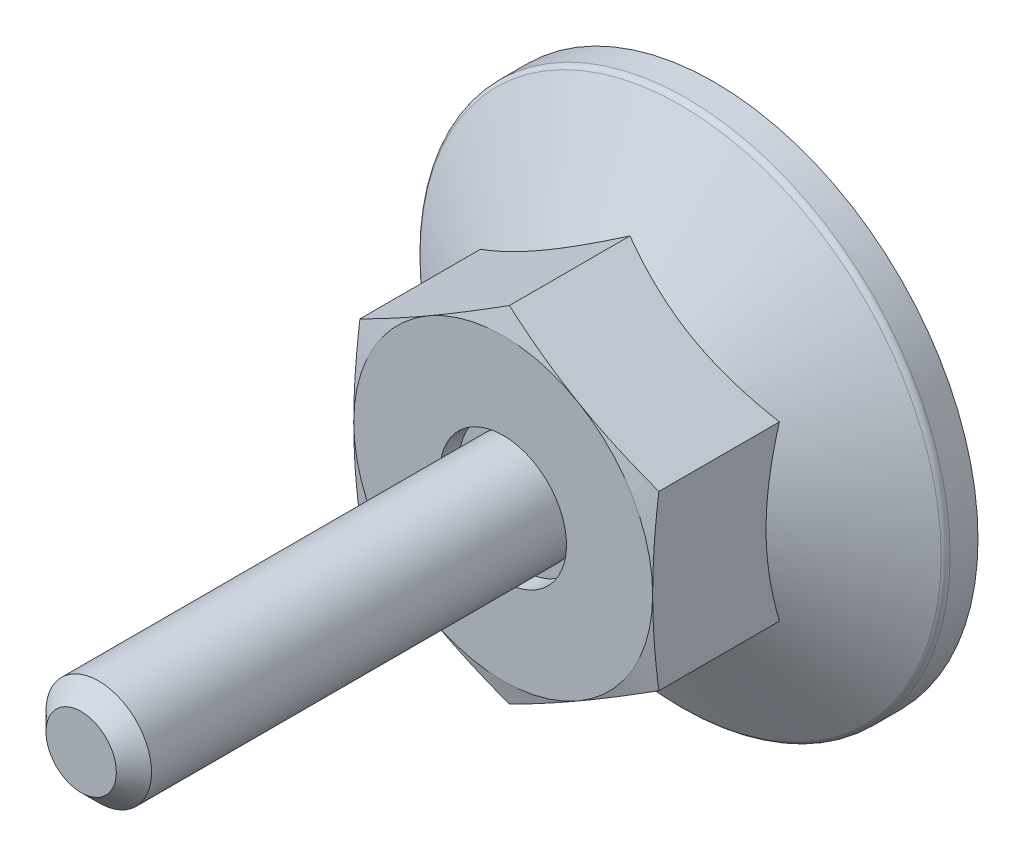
ISO-10303-21;
HEADER;
FILE_DESCRIPTION(('STEP AP214'),'2;1');
FILE_NAME('part.step','',(''),(''),'','','');
FILE_SCHEMA(('AUTOMOTIVE_DESIGN { 1 0 10303 214 1 1 1 1 }'));
ENDSEC;
DATA;
#1=APPLICATION_CONTEXT('core data for automotive mechanical design processes');
#2=APPLICATION_PROTOCOL_DEFINITION('international standard','automotive_design',2000,#1);
#3=PRODUCT_CONTEXT('',#1,'mechanical');
#4=PRODUCT('Part','Part','',(#3));
#5=PRODUCT_RELATED_PRODUCT_CATEGORY('part','',(#4));
#6=PRODUCT_DEFINITION_FORMATION('','',#4);
#7=PRODUCT_DEFINITION_CONTEXT('part definition',#1,'design');
#8=PRODUCT_DEFINITION('design','',#6,#7);
#9=PRODUCT_DEFINITION_SHAPE('','',#8);
#10=(LENGTH_UNIT() NAMED_UNIT(*) SI_UNIT(.MILLI.,.METRE.));
#11=(NAMED_UNIT(*) PLANE_ANGLE_UNIT() SI_UNIT($,.RADIAN.));
#12=(NAMED_UNIT(*) SI_UNIT($,.STERADIAN.) SOLID_ANGLE_UNIT());
#13=UNCERTAINTY_MEASURE_WITH_UNIT(LENGTH_MEASURE(1.E-05),#10,'distance_accuracy_value','');
#14=(GEOMETRIC_REPRESENTATION_CONTEXT(3) GLOBAL_UNCERTAINTY_ASSIGNED_CONTEXT((#13)) GLOBAL_UNIT_ASSIGNED_CONTEXT((#10,
#11,#12)) REPRESENTATION_CONTEXT('',''));
#15=CARTESIAN_POINT('',(0.,0.,0.));
#16=DIRECTION('',(0.,0.,1.));
#17=DIRECTION('',(1.,0.,0.));
#18=AXIS2_PLACEMENT_3D('',#15,#16,#17);
#19=CARTESIAN_POINT('',(10.2,0.,0.));
#20=DIRECTION('',(0.,0.,1.));
#21=DIRECTION('',(0.,-1.,0.));
#22=AXIS2_PLACEMENT_3D('',#19,#20,#21);
#23=PLANE('',#22);
#24=DIRECTION('',(1.,0.,0.));
#25=VECTOR('',#24,1.);
#26=CARTESIAN_POINT('',(1.,-1.,0.));
#27=LINE('',#26,#25);
#28=CARTESIAN_POINT('',(1.,-1.,0.));
#29=VERTEX_POINT('',#28);
#30=CARTESIAN_POINT('',(5.,-1.,0.));
#31=VERTEX_POINT('',#30);
#32=EDGE_CURVE('E353',#29,#31,#27,.T.);
#33=ORIENTED_EDGE('',*,*,#32,.T.);
#34=DIRECTION('',(0.,-1.,0.));
#35=VECTOR('',#34,1.);
#36=CARTESIAN_POINT('',(5.,0.,0.));
#37=LINE('',#36,#35);
#38=CARTESIAN_POINT('',(5.,1.,0.));
#39=VERTEX_POINT('',#38);
#40=EDGE_CURVE('E375',#39,#31,#37,.T.);
#41=ORIENTED_EDGE('',*,*,#40,.F.);
#42=DIRECTION('',(-1.,0.,0.));
#43=VECTOR('',#42,1.);
#44=CARTESIAN_POINT('',(5.,1.,0.));
#45=LINE('',#44,#43);
#46=CARTESIAN_POINT('',(1.,1.,0.));
#47=VERTEX_POINT('',#46);
#48=EDGE_CURVE('E737',#39,#47,#45,.T.);
#49=ORIENTED_EDGE('',*,*,#48,.T.);
#50=DIRECTION('',(0.,1.,0.));
#51=VECTOR('',#50,1.);
#52=CARTESIAN_POINT('',(1.,1.,0.));
#53=LINE('',#52,#51);
#54=CARTESIAN_POINT('',(1.,5.,0.));
#55=VERTEX_POINT('',#54);
#56=EDGE_CURVE('E734',#47,#55,#53,.T.);
#57=ORIENTED_EDGE('',*,*,#56,.T.);
#58=DIRECTION('',(-1.,0.,0.));
#59=VECTOR('',#58,1.);
#60=CARTESIAN_POINT('',(1.,5.,0.));
#61=LINE('',#60,#59);
#62=CARTESIAN_POINT('',(-1.,5.,0.));
#63=VERTEX_POINT('',#62);
#64=EDGE_CURVE('E728',#55,#63,#61,.T.);
#65=ORIENTED_EDGE('',*,*,#64,.T.);
#66=DIRECTION('',(0.,-1.,0.));
#67=VECTOR('',#66,1.);
#68=CARTESIAN_POINT('',(-1.,5.,0.));
#69=LINE('',#68,#67);
#70=CARTESIAN_POINT('',(-1.,1.,0.));
#71=VERTEX_POINT('',#70);
#72=EDGE_CURVE('E175',#63,#71,#69,.T.);
#73=ORIENTED_EDGE('',*,*,#72,.T.);
#74=DIRECTION('',(-1.,0.,0.));
#75=VECTOR('',#74,1.);
#76=CARTESIAN_POINT('',(-1.,1.,0.));
#77=LINE('',#76,#75);
#78=CARTESIAN_POINT('',(-5.,1.,0.));
#79=VERTEX_POINT('',#78);
#80=EDGE_CURVE('E29',#71,#79,#77,.T.);
#81=ORIENTED_EDGE('',*,*,#80,.T.);
#82=DIRECTION('',(0.,-1.,0.));
#83=VECTOR('',#82,1.);
#84=CARTESIAN_POINT('',(-5.,1.,0.));
#85=LINE('',#84,#83);
#86=CARTESIAN_POINT('',(-5.,-1.,0.));
#87=VERTEX_POINT('',#86);
#88=EDGE_CURVE('E179',#79,#87,#85,.T.);
#89=ORIENTED_EDGE('',*,*,#88,.T.);
#90=DIRECTION('',(1.,0.,0.));
#91=VECTOR('',#90,1.);
#92=CARTESIAN_POINT('',(-5.,-1.,0.));
#93=LINE('',#92,#91);
#94=CARTESIAN_POINT('',(-1.,-1.,0.));
#95=VERTEX_POINT('',#94);
#96=EDGE_CURVE('E762',#87,#95,#93,.T.);
#97=ORIENTED_EDGE('',*,*,#96,.T.);
#98=DIRECTION('',(0.,-1.,0.));
#99=VECTOR('',#98,1.);
#100=CARTESIAN_POINT('',(-1.,-1.,0.));
#101=LINE('',#100,#99);
#102=CARTESIAN_POINT('',(-1.,-5.,0.));
#103=VERTEX_POINT('',#102);
#104=EDGE_CURVE('E764',#95,#103,#101,.T.);
#105=ORIENTED_EDGE('',*,*,#104,.T.);
#106=DIRECTION('',(1.,0.,0.));
#107=VECTOR('',#106,1.);
#108=CARTESIAN_POINT('',(-1.,-5.,0.));
#109=LINE('',#108,#107);
#110=CARTESIAN_POINT('',(1.,-5.,0.));
#111=VERTEX_POINT('',#110);
#112=EDGE_CURVE('E768',#103,#111,#109,.T.);
#113=ORIENTED_EDGE('',*,*,#112,.T.);
#114=DIRECTION('',(0.,1.,0.));
#115=VECTOR('',#114,1.);
#116=CARTESIAN_POINT('',(1.,-5.,0.));
#117=LINE('',#116,#115);
#118=EDGE_CURVE('E775',#111,#29,#117,.T.);
#119=ORIENTED_EDGE('',*,*,#118,.T.);
#120=EDGE_LOOP('',(#33,#41,#49,#57,#65,#73,#81,#89,#97,#105,#113,#119));
#121=FACE_BOUND('',#120,.T.);
#122=CARTESIAN_POINT('',(0.,0.,0.));
#123=DIRECTION('',(0.,0.,-1.));
#124=DIRECTION('',(0.,1.,0.));
#125=AXIS2_PLACEMENT_3D('',#122,#123,#124);
#126=CIRCLE('',#125,15.);
#127=CARTESIAN_POINT('',(0.,15.,0.));
#128=VERTEX_POINT('',#127);
#129=EDGE_CURVE('E184',#128,#128,#126,.T.);
#130=ORIENTED_EDGE('',*,*,#129,.T.);
#131=EDGE_LOOP('',(#130));
#132=FACE_BOUND('',#131,.T.);
#133=ADVANCED_FACE('F14',(#121,#132),#23,.F.);
#134=CARTESIAN_POINT('',(0.,0.,10.9));
#135=DIRECTION('',(0.,0.,-1.));
#136=DIRECTION('',(0.,1.,0.));
#137=AXIS2_PLACEMENT_3D('',#134,#135,#136);
#138=PLANE('',#137);
#139=CARTESIAN_POINT('',(0.,0.,10.9));
#140=DIRECTION('',(0.,0.,-1.));
#141=DIRECTION('',(0.,1.,0.));
#142=AXIS2_PLACEMENT_3D('',#139,#140,#141);
#143=CIRCLE('',#142,3.6);
#144=CARTESIAN_POINT('',(0.,3.6,10.9));
#145=VERTEX_POINT('',#144);
#146=EDGE_CURVE('E376',#145,#145,#143,.T.);
#147=ORIENTED_EDGE('',*,*,#146,.F.);
#148=EDGE_LOOP('',(#147));
#149=FACE_BOUND('',#148,.T.);
#150=CARTESIAN_POINT('',(0.,0.,10.9));
#151=DIRECTION('',(0.,0.,-1.));
#152=DIRECTION('',(0.,1.,0.));
#153=AXIS2_PLACEMENT_3D('',#150,#151,#152);
#154=CIRCLE('',#153,3.);
#155=CARTESIAN_POINT('',(0.,3.,10.9));
#156=VERTEX_POINT('',#155);
#157=EDGE_CURVE('E180',#156,#156,#154,.F.);
#158=ORIENTED_EDGE('',*,*,#157,.F.);
#159=EDGE_LOOP('',(#158));
#160=FACE_BOUND('',#159,.T.);
#161=ADVANCED_FACE('F341',(#149,#160),#138,.F.);
#162=CARTESIAN_POINT('',(0.,9.81495457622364,44.));
#163=DIRECTION('',(0.5,-0.866025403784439,0.));
#164=DIRECTION('',(0.866025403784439,0.5,0.));
#165=AXIS2_PLACEMENT_3D('',#162,#163,#164);
#166=PLANE('',#165);
#167=CARTESIAN_POINT('',(-8.5002,4.90736181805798,4.7935207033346));
#168=CARTESIAN_POINT('',(-8.31336077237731,5.01523349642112,4.85579061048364));
#169=CARTESIAN_POINT('',(-8.1258249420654,5.1235073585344,4.91523445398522));
#170=CARTESIAN_POINT('',(-7.74923024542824,5.34093440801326,5.02769163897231));
#171=CARTESIAN_POINT('',(-7.56017075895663,5.45008795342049,5.08070220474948));
#172=CARTESIAN_POINT('',(-6.9899652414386,5.77929626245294,5.22904336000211));
#173=CARTESIAN_POINT('',(-6.60656835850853,6.00065055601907,5.31341782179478));
#174=CARTESIAN_POINT('',(-6.03282233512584,6.33190297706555,5.41235673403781));
#175=CARTESIAN_POINT('',(-5.84418723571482,6.44081150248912,5.44054155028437));
#176=CARTESIAN_POINT('',(-5.46606397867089,6.65912106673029,5.48780266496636));
#177=CARTESIAN_POINT('',(-5.27657589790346,6.76852206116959,5.5068797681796));
#178=CARTESIAN_POINT('',(-4.8972734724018,6.98751241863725,5.53544197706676));
#179=CARTESIAN_POINT('',(-4.70745974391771,7.09710142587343,5.54493796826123));
#180=CARTESIAN_POINT('',(-4.32765694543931,7.3163806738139,5.55413437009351));
#181=CARTESIAN_POINT('',(-4.13766788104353,7.42607091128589,5.5538350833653));
#182=CARTESIAN_POINT('',(-3.78247698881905,7.63114046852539,5.54412227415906));
#183=CARTESIAN_POINT('',(-3.6172500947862,7.72653426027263,5.535893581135));
#184=CARTESIAN_POINT('',(-3.28718328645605,7.9170984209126,5.51218750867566));
#185=CARTESIAN_POINT('',(-3.12234339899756,8.01226877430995,5.49670964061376));
#186=CARTESIAN_POINT('',(-2.62846189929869,8.29741139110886,5.43976812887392));
#187=CARTESIAN_POINT('',(-2.30029449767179,8.48687892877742,5.38780368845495));
#188=CARTESIAN_POINT('',(-1.64047857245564,8.86782383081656,5.25789180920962));
#189=CARTESIAN_POINT('',(-1.30891425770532,9.05925257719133,5.17939367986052));
#190=CARTESIAN_POINT('',(-0.650730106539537,9.43925537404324,5.00123540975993));
#191=CARTESIAN_POINT('',(-0.324101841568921,9.62783429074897,4.90161711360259));
#192=CARTESIAN_POINT('',(0.000199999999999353,9.81507004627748,4.7935207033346));
#193=B_SPLINE_CURVE_WITH_KNOTS('',3,(#167,#168,#169,#170,#171,#172,#173,#174,#175,#176,#177,
#178,#179,#180,#181,#182,#183,#184,#185,#186,#187,#188,#189,#190,#191,#192),.UNSPECIFIED.,.F.,
.F.,(4,2,2,2,2,2,2,2,2,2,2,2,4),(0.,0.673596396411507,1.34748239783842,2.69805431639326,
3.356799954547,4.01548737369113,4.67342558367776,5.33134346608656,5.90409556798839,
6.47688628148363,7.62328361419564,8.79510569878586,9.9646274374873),.UNSPECIFIED.);
#194=CARTESIAN_POINT('',(-8.5,4.90747728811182,4.79358737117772));
#195=VERTEX_POINT('',#194);
#196=CARTESIAN_POINT('',(0.,9.81495457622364,4.79358737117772));
#197=VERTEX_POINT('',#196);
#198=EDGE_CURVE('E254',#195,#197,#193,.T.);
#199=ORIENTED_EDGE('',*,*,#198,.F.);
#200=DIRECTION('',(0.,0.,-1.));
#201=VECTOR('',#200,1.);
#202=CARTESIAN_POINT('',(-8.5,4.90747728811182,44.));
#203=LINE('',#202,#201);
#204=CARTESIAN_POINT('',(-8.5,4.90747728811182,11.6476589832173));
#205=VERTEX_POINT('',#204);
#206=EDGE_CURVE('E429',#205,#195,#203,.T.);
#207=ORIENTED_EDGE('',*,*,#206,.F.);
#208=CARTESIAN_POINT('',(0.000200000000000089,9.81507004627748,11.6476280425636));
#209=CARTESIAN_POINT('',(-0.352800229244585,9.61126526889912,11.7022599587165));
#210=CARTESIAN_POINT('',(-0.706440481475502,9.40709097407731,11.7518566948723));
#211=CARTESIAN_POINT('',(-1.41496987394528,8.99802133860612,11.8389934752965));
#212=CARTESIAN_POINT('',(-1.76985946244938,8.79312573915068,11.8765286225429));
#213=CARTESIAN_POINT('',(-2.47873586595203,8.38385575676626,11.9373509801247));
#214=CARTESIAN_POINT('',(-2.83271788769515,8.17948414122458,11.9607107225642));
#215=CARTESIAN_POINT('',(-3.5411333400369,7.77048028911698,11.9920337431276));
#216=CARTESIAN_POINT('',(-3.89556667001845,7.56584811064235,12.));
#217=CARTESIAN_POINT('',(-4.60443332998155,7.15658375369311,12.));
#218=CARTESIAN_POINT('',(-4.9588666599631,6.95195157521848,11.9920337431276));
#219=CARTESIAN_POINT('',(-5.66728211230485,6.54294772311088,11.9607107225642));
#220=CARTESIAN_POINT('',(-6.02126413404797,6.33857610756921,11.9373509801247));
#221=CARTESIAN_POINT('',(-6.73014053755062,5.92930612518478,11.8765286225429));
#222=CARTESIAN_POINT('',(-7.08503012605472,5.72441052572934,11.8389934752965));
#223=CARTESIAN_POINT('',(-7.7935595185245,5.31534089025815,11.7518566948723));
#224=CARTESIAN_POINT('',(-8.14719977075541,5.11116659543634,11.7022599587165));
#225=CARTESIAN_POINT('',(-8.5002,4.90736181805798,11.6476280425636));
#226=B_SPLINE_CURVE_WITH_KNOTS('',3,(#208,#209,#210,#211,#212,#213,#214,#215,#216,#217,#218,
#219,#220,#221,#222,#223,#224,#225),.UNSPECIFIED.,.F.,.F.,(4,2,2,2,2,2,2,2,4),(0.,
1.23382789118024,2.46815608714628,3.69611406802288,4.92383440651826,6.15155474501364,
7.37951272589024,8.61384092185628,9.84766881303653),.UNSPECIFIED.);
#227=CARTESIAN_POINT('',(-4.25,7.36121593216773,12.));
#228=VERTEX_POINT('',#227);
#229=EDGE_CURVE('E284',#228,#205,#226,.T.);
#230=ORIENTED_EDGE('',*,*,#229,.F.);
#231=CARTESIAN_POINT('',(0.,9.81495457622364,11.6476589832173));
#232=VERTEX_POINT('',#231);
#233=EDGE_CURVE('E394',#232,#228,#226,.T.);
#234=ORIENTED_EDGE('',*,*,#233,.F.);
#235=DIRECTION('',(0.,0.,-1.));
#236=VECTOR('',#235,1.);
#237=CARTESIAN_POINT('',(0.,9.81495457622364,44.));
#238=LINE('',#237,#236);
#239=EDGE_CURVE('E415',#232,#197,#238,.T.);
#240=ORIENTED_EDGE('',*,*,#239,.T.);
#241=EDGE_LOOP('',(#199,#207,#230,#234,#240));
#242=FACE_BOUND('',#241,.T.);
#243=ADVANCED_FACE('F226',(#242),#166,.F.);
#244=CARTESIAN_POINT('',(8.5,4.90747728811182,44.));
#245=DIRECTION('',(-0.5,-0.866025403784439,0.));
#246=DIRECTION('',(0.866025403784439,-0.5,0.));
#247=AXIS2_PLACEMENT_3D('',#244,#245,#246);
#248=PLANE('',#247);
#249=CARTESIAN_POINT('',(-0.0002,9.81507004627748,4.7935207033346));
#250=CARTESIAN_POINT('',(0.186639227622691,9.70719836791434,4.85579061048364));
#251=CARTESIAN_POINT('',(0.374175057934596,9.59892450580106,4.91523445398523));
#252=CARTESIAN_POINT('',(0.750769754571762,9.3814974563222,5.02769163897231));
#253=CARTESIAN_POINT('',(0.939829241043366,9.27234391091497,5.08070220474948));
#254=CARTESIAN_POINT('',(1.5100347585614,8.94313560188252,5.22904336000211));
#255=CARTESIAN_POINT('',(1.89343164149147,8.72178130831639,5.31341782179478));
#256=CARTESIAN_POINT('',(2.46717766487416,8.39052888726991,5.41235673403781));
#257=CARTESIAN_POINT('',(2.65581276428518,8.28162036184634,5.44054155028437));
#258=CARTESIAN_POINT('',(3.03393602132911,8.06331079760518,5.48780266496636));
#259=CARTESIAN_POINT('',(3.22342410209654,7.95390980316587,5.5068797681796));
#260=CARTESIAN_POINT('',(3.6027265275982,7.73491944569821,5.53544197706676));
#261=CARTESIAN_POINT('',(3.79254025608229,7.62533043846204,5.54493796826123));
#262=CARTESIAN_POINT('',(4.17234305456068,7.40605119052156,5.55413437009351));
#263=CARTESIAN_POINT('',(4.36233211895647,7.29636095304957,5.55383508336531));
#264=CARTESIAN_POINT('',(4.71752301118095,7.09129139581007,5.54412227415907));
#265=CARTESIAN_POINT('',(4.8827499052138,6.99589760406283,5.53589358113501));
#266=CARTESIAN_POINT('',(5.21281671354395,6.80533344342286,5.51218750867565));
#267=CARTESIAN_POINT('',(5.37765660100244,6.71016309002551,5.49670964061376));
#268=CARTESIAN_POINT('',(5.87153810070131,6.42502047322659,5.43976812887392));
#269=CARTESIAN_POINT('',(6.19970550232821,6.23555293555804,5.38780368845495));
#270=CARTESIAN_POINT('',(6.85952142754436,5.8546080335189,5.25789180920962));
#271=CARTESIAN_POINT('',(7.19108574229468,5.66317928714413,5.17939367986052));
#272=CARTESIAN_POINT('',(7.84926989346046,5.28317649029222,5.00123540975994));
#273=CARTESIAN_POINT('',(8.17589815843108,5.09459757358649,4.90161711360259));
#274=CARTESIAN_POINT('',(8.5002,4.90736181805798,4.7935207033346));
#275=B_SPLINE_CURVE_WITH_KNOTS('',3,(#249,#250,#251,#252,#253,#254,#255,#256,#257,#258,#259,
#260,#261,#262,#263,#264,#265,#266,#267,#268,#269,#270,#271,#272,#273,#274),.UNSPECIFIED.,.F.,
.F.,(4,2,2,2,2,2,2,2,2,2,2,2,4),(0.,0.673596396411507,1.34748239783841,2.69805431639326,
3.356799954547,4.01548737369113,4.67342558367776,5.33134346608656,5.90409556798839,
6.47688628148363,7.62328361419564,8.79510569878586,9.9646274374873),.UNSPECIFIED.);
#276=CARTESIAN_POINT('',(8.5,4.90747728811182,4.79358737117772));
#277=VERTEX_POINT('',#276);
#278=EDGE_CURVE('E37',#197,#277,#275,.T.);
#279=ORIENTED_EDGE('',*,*,#278,.F.);
#280=ORIENTED_EDGE('',*,*,#239,.F.);
#281=CARTESIAN_POINT('',(8.5002,4.90736181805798,11.6476280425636));
#282=CARTESIAN_POINT('',(8.14719977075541,5.11116659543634,11.7022599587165));
#283=CARTESIAN_POINT('',(7.7935595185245,5.31534089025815,11.7518566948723));
#284=CARTESIAN_POINT('',(7.08503012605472,5.72441052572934,11.8389934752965));
#285=CARTESIAN_POINT('',(6.73014053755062,5.92930612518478,11.8765286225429));
#286=CARTESIAN_POINT('',(6.02126413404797,6.33857610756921,11.9373509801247));
#287=CARTESIAN_POINT('',(5.66728211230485,6.54294772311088,11.9607107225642));
#288=CARTESIAN_POINT('',(4.9588666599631,6.95195157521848,11.9920337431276));
#289=CARTESIAN_POINT('',(4.60443332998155,7.15658375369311,12.));
#290=CARTESIAN_POINT('',(3.89556667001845,7.56584811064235,12.));
#291=CARTESIAN_POINT('',(3.5411333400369,7.77048028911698,11.9920337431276));
#292=CARTESIAN_POINT('',(2.83271788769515,8.17948414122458,11.9607107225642));
#293=CARTESIAN_POINT('',(2.47873586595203,8.38385575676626,11.9373509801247));
#294=CARTESIAN_POINT('',(1.76985946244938,8.79312573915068,11.8765286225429));
#295=CARTESIAN_POINT('',(1.41496987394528,8.99802133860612,11.8389934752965));
#296=CARTESIAN_POINT('',(0.706440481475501,9.40709097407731,11.7518566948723));
#297=CARTESIAN_POINT('',(0.352800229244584,9.61126526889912,11.7022599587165));
#298=CARTESIAN_POINT('',(-0.000200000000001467,9.81507004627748,11.6476280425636));
#299=B_SPLINE_CURVE_WITH_KNOTS('',3,(#281,#282,#283,#284,#285,#286,#287,#288,#289,#290,#291,
#292,#293,#294,#295,#296,#297,#298),.UNSPECIFIED.,.F.,.F.,(4,2,2,2,2,2,2,2,4),(0.,
1.23382789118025,2.46815608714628,3.69611406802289,4.92383440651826,6.15155474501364,
7.37951272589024,8.61384092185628,9.84766881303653),.UNSPECIFIED.);
#300=CARTESIAN_POINT('',(4.25,7.36121593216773,12.));
#301=VERTEX_POINT('',#300);
#302=EDGE_CURVE('E267',#301,#232,#299,.T.);
#303=ORIENTED_EDGE('',*,*,#302,.F.);
#304=CARTESIAN_POINT('',(8.5,4.90747728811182,11.6476589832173));
#305=VERTEX_POINT('',#304);
#306=EDGE_CURVE('E276',#305,#301,#299,.T.);
#307=ORIENTED_EDGE('',*,*,#306,.F.);
#308=DIRECTION('',(0.,0.,-1.));
#309=VECTOR('',#308,1.);
#310=CARTESIAN_POINT('',(8.5,4.90747728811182,44.));
#311=LINE('',#310,#309);
#312=EDGE_CURVE('E417',#305,#277,#311,.T.);
#313=ORIENTED_EDGE('',*,*,#312,.T.);
#314=EDGE_LOOP('',(#279,#280,#303,#307,#313));
#315=FACE_BOUND('',#314,.T.);
#316=ADVANCED_FACE('F260',(#315),#248,.F.);
#317=CARTESIAN_POINT('',(8.5,-4.90747728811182,44.));
#318=DIRECTION('',(-1.,0.,0.));
#319=DIRECTION('',(0.,-1.,0.));
#320=AXIS2_PLACEMENT_3D('',#317,#318,#319);
#321=PLANE('',#320);
#322=CARTESIAN_POINT('',(8.5,13.0314294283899,1.47752704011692));
#323=CARTESIAN_POINT('',(8.5,12.6612665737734,1.65647774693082));
#324=CARTESIAN_POINT('',(8.5,12.290237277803,1.83366776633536));
#325=CARTESIAN_POINT('',(8.5,11.5459841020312,2.1835324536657));
#326=CARTESIAN_POINT('',(8.5,11.1727598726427,2.3562063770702));
#327=CARTESIAN_POINT('',(8.5,10.4216603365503,2.69694543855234));
#328=CARTESIAN_POINT('',(8.5,10.0437706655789,2.86497902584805));
#329=CARTESIAN_POINT('',(8.5,9.2849306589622,3.19396010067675));
#330=CARTESIAN_POINT('',(8.5,8.90398047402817,3.35490793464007));
#331=CARTESIAN_POINT('',(8.5,8.12702308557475,3.67249615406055));
#332=CARTESIAN_POINT('',(8.5,7.73090483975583,3.82886642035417));
#333=CARTESIAN_POINT('',(8.5,6.93398073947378,4.12940330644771));
#334=CARTESIAN_POINT('',(8.5,6.53317435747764,4.27356853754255));
#335=CARTESIAN_POINT('',(8.5,5.72703031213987,4.54580160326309));
#336=CARTESIAN_POINT('',(8.5,5.32170421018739,4.67390329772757));
#337=CARTESIAN_POINT('',(8.5,4.50525785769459,4.90980359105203));
#338=CARTESIAN_POINT('',(8.5,4.09413952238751,5.01760873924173));
#339=CARTESIAN_POINT('',(8.5,3.26789885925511,5.20711197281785));
#340=CARTESIAN_POINT('',(8.5,2.85280627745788,5.28893618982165));
#341=CARTESIAN_POINT('',(8.5,2.22651264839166,5.38853539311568));
#342=CARTESIAN_POINT('',(8.5,2.01712321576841,5.41788026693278));
#343=CARTESIAN_POINT('',(8.5,1.59735566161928,5.46827917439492));
#344=CARTESIAN_POINT('',(8.5,1.38697763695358,5.48933400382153));
#345=CARTESIAN_POINT('',(8.5,0.968196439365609,5.52247691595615));
#346=CARTESIAN_POINT('',(8.5,0.759802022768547,5.53467524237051));
#347=CARTESIAN_POINT('',(8.5,0.342684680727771,5.55026003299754));
#348=CARTESIAN_POINT('',(8.5,0.133961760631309,5.5536466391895));
#349=CARTESIAN_POINT('',(8.5,-0.283445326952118,5.55152742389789));
#350=CARTESIAN_POINT('',(8.5,-0.492129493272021,5.546021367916));
#351=CARTESIAN_POINT('',(8.5,-0.909085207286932,5.52624824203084));
#352=CARTESIAN_POINT('',(8.5,-1.11735673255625,5.51198070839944));
#353=CARTESIAN_POINT('',(8.5,-1.62231800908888,5.46706351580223));
#354=CARTESIAN_POINT('',(8.5,-1.91862399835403,5.43201243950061));
#355=CARTESIAN_POINT('',(8.5,-2.50892471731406,5.34612267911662));
#356=CARTESIAN_POINT('',(8.5,-2.80291910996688,5.29528173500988));
#357=CARTESIAN_POINT('',(8.5,-3.68114216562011,5.12178025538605));
#358=CARTESIAN_POINT('',(8.5,-4.26128126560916,4.97817413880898));
#359=CARTESIAN_POINT('',(8.5,-5.12903133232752,4.73045572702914));
#360=CARTESIAN_POINT('',(8.5,-5.42116721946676,4.64129591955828));
#361=CARTESIAN_POINT('',(8.5,-6.0025970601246,4.45406394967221));
#362=CARTESIAN_POINT('',(8.5,-6.29189099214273,4.35599171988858));
#363=CARTESIAN_POINT('',(8.5,-6.86774141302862,4.15248019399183));
#364=CARTESIAN_POINT('',(8.5,-7.15429879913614,4.0470434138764));
#365=CARTESIAN_POINT('',(8.5,-7.72505625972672,3.83000899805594));
#366=CARTESIAN_POINT('',(8.5,-8.00925638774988,3.71841150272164));
#367=CARTESIAN_POINT('',(8.5,-8.7865968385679,3.40502511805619));
#368=CARTESIAN_POINT('',(8.5,-9.2776226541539,3.197996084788));
#369=CARTESIAN_POINT('',(8.5,-10.2546964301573,2.77246752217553));
#370=CARTESIAN_POINT('',(8.5,-10.7407438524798,2.55396676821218));
#371=CARTESIAN_POINT('',(8.5,-11.7090438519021,2.108282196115));
#372=CARTESIAN_POINT('',(8.5,-12.1912949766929,1.88109523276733));
#373=CARTESIAN_POINT('',(8.5,-13.1526185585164,1.42016244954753));
#374=CARTESIAN_POINT('',(8.5,-13.6316911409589,1.18641689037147));
#375=CARTESIAN_POINT('',(8.5,-14.588034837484,0.713462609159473));
#376=CARTESIAN_POINT('',(8.5,-15.0653020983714,0.47424611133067));
#377=CARTESIAN_POINT('',(8.5,-16.0177905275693,-0.00822936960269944));
#378=CARTESIAN_POINT('',(8.5,-16.4930116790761,-0.251488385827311));
#379=CARTESIAN_POINT('',(8.5,-17.4416812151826,-0.741191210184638));
#380=CARTESIAN_POINT('',(8.5,-17.9151299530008,-0.987634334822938));
#381=CARTESIAN_POINT('',(8.5,-18.8606492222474,-1.48315179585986));
#382=CARTESIAN_POINT('',(8.5,-19.3327197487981,-1.73222614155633));
#383=CARTESIAN_POINT('',(8.5,-20.6461392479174,-2.42904815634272));
#384=CARTESIAN_POINT('',(8.5,-21.4862394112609,-2.87914918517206));
#385=CARTESIAN_POINT('',(8.5,-23.1638169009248,-3.78432075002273));
#386=CARTESIAN_POINT('',(8.5,-24.0012940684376,-4.23939157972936));
#387=CARTESIAN_POINT('',(8.5,-25.671623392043,-5.15180725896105));
#388=CARTESIAN_POINT('',(8.5,-26.5044818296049,-5.60914061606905));
#389=CARTESIAN_POINT('',(8.5,-27.7525740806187,-6.29723391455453));
#390=CARTESIAN_POINT('',(8.5,-28.1683903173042,-6.52693873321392));
#391=CARTESIAN_POINT('',(8.5,-28.9996764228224,-6.98697325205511));
#392=CARTESIAN_POINT('',(8.5,-29.4151462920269,-7.21730295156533));
#393=CARTESIAN_POINT('',(8.5,-29.8304643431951,-7.44790614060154));
#394=B_SPLINE_CURVE_WITH_KNOTS('',3,(#322,#323,#324,#325,#326,#327,#328,#329,#330,#331,#332,
#333,#334,#335,#336,#337,#338,#339,#340,#341,#342,#343,#344,#345,#346,#347,#348,#349,#350,#351,
#352,#353,#354,#355,#356,#357,#358,#359,#360,#361,#362,#363,#364,#365,#366,#367,#368,#369,#370,
#371,#372,#373,#374,#375,#376,#377,#378,#379,#380,#381,#382,#383,#384,#385,#386,#387,#388,#389,
#390,#391,#392,#393),.UNSPECIFIED.,.F.,.F.,(4,2,2,2,2,2,2,2,2,2,2,2,2,2,2,2,2,2,2,2,2,2,2,2,2,2,
2,2,2,2,2,2,2,2,2,4),(0.,1.23346428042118,2.46713064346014,3.70776702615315,4.94834268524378,
6.22578289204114,7.5033682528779,8.77821366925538,10.0526470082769,11.32079515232,
11.9549638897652,12.5890717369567,13.2151443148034,13.8412068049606,14.4672858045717,
15.0933979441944,15.9880059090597,16.8827419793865,18.6732029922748,19.5894472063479,
20.5056983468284,21.4216379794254,22.3375567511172,23.9359919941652,25.5345982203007,
27.1337888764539,28.7329160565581,30.3344778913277,31.9360528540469,33.5372895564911,
35.1385319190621,37.9977422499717,40.8571224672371,43.7075995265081,45.1327331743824,
46.5578652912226),.UNSPECIFIED.);
#395=CARTESIAN_POINT('',(8.5,-4.90747728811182,4.79358737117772));
#396=VERTEX_POINT('',#395);
#397=EDGE_CURVE('E243',#277,#396,#394,.T.);
#398=ORIENTED_EDGE('',*,*,#397,.F.);
#399=ORIENTED_EDGE('',*,*,#312,.F.);
#400=CARTESIAN_POINT('',(8.5,12.9820891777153,10.1197370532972));
#401=CARTESIAN_POINT('',(8.5,12.5964686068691,10.2061594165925));
#402=CARTESIAN_POINT('',(8.5,12.2106068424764,10.2915248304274));
#403=CARTESIAN_POINT('',(8.5,11.4382824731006,10.4595712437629));
#404=CARTESIAN_POINT('',(8.5,11.0518198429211,10.5422521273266));
#405=CARTESIAN_POINT('',(8.5,10.2778290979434,10.7044309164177));
#406=CARTESIAN_POINT('',(8.5,9.89030030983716,10.7839256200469));
#407=CARTESIAN_POINT('',(8.5,9.11443612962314,10.9388739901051));
#408=CARTESIAN_POINT('',(8.5,8.72610074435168,11.0143276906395));
#409=CARTESIAN_POINT('',(8.5,7.95158013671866,11.159650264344));
#410=CARTESIAN_POINT('',(8.5,7.56540239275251,11.2295587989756));
#411=CARTESIAN_POINT('',(8.5,6.79199352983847,11.3632725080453));
#412=CARTESIAN_POINT('',(8.5,6.40476243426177,11.4270778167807));
#413=CARTESIAN_POINT('',(8.5,5.62917169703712,11.54714843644));
#414=CARTESIAN_POINT('',(8.5,5.24081220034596,11.6034146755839));
#415=CARTESIAN_POINT('',(8.5,4.46285737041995,11.70674908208));
#416=CARTESIAN_POINT('',(8.5,4.07326203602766,11.7538172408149));
#417=CARTESIAN_POINT('',(8.5,3.28844017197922,11.8374226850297));
#418=CARTESIAN_POINT('',(8.5,2.89320002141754,11.8738340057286));
#419=CARTESIAN_POINT('',(8.5,2.10172608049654,11.9336139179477));
#420=CARTESIAN_POINT('',(8.5,1.70549231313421,11.9569828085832));
#421=CARTESIAN_POINT('',(8.5,0.91260591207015,11.9893148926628));
#422=CARTESIAN_POINT('',(8.5,0.515953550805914,11.9982846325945));
#423=CARTESIAN_POINT('',(8.5,-0.277408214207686,12.0012669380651));
#424=CARTESIAN_POINT('',(8.5,-0.674117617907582,11.9952795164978));
#425=CARTESIAN_POINT('',(8.5,-1.46847963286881,11.9686842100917));
#426=CARTESIAN_POINT('',(8.5,-1.86613043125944,11.9480232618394));
#427=CARTESIAN_POINT('',(8.5,-2.66049684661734,11.8932602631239));
#428=CARTESIAN_POINT('',(8.5,-3.05721244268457,11.8591579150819));
#429=CARTESIAN_POINT('',(8.5,-3.84970511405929,11.7792347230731));
#430=CARTESIAN_POINT('',(8.5,-4.24548140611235,11.7334062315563));
#431=CARTESIAN_POINT('',(8.5,-5.03576028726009,11.6319377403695));
#432=CARTESIAN_POINT('',(8.5,-5.43026287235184,11.5762977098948));
#433=CARTESIAN_POINT('',(8.5,-6.19195385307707,11.4609360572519));
#434=CARTESIAN_POINT('',(8.5,-6.55922094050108,11.4017287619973));
#435=CARTESIAN_POINT('',(8.5,-7.29278719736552,11.2775674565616));
#436=CARTESIAN_POINT('',(8.5,-7.65908634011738,11.2126132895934));
#437=CARTESIAN_POINT('',(8.5,-8.39085027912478,11.078008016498));
#438=CARTESIAN_POINT('',(8.5,-8.75631499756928,11.0083564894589));
#439=CARTESIAN_POINT('',(8.5,-9.48649515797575,10.8652200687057));
#440=CARTESIAN_POINT('',(8.5,-9.85121059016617,10.7917351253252));
#441=CARTESIAN_POINT('',(8.5,-10.5800753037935,10.6416087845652));
#442=CARTESIAN_POINT('',(8.5,-10.944224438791,10.5649666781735));
#443=CARTESIAN_POINT('',(8.5,-11.6719684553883,10.4090909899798));
#444=CARTESIAN_POINT('',(8.5,-12.0355633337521,10.3298573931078));
#445=CARTESIAN_POINT('',(8.5,-13.1255915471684,10.0889686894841));
#446=CARTESIAN_POINT('',(8.5,-13.8513178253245,9.92411536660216));
#447=CARTESIAN_POINT('',(8.5,-15.2942598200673,9.59010912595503));
#448=CARTESIAN_POINT('',(8.5,-16.0114890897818,9.42101437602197));
#449=CARTESIAN_POINT('',(8.5,-17.4449475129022,9.07858755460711));
#450=CARTESIAN_POINT('',(8.5,-18.1611766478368,8.90525540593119));
#451=CARTESIAN_POINT('',(8.5,-19.5919856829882,8.5556799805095));
#452=CARTESIAN_POINT('',(8.5,-20.306566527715,8.37944056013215));
#453=CARTESIAN_POINT('',(8.5,-21.7351057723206,8.02455520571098));
#454=CARTESIAN_POINT('',(8.5,-22.4490641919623,7.8459093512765));
#455=CARTESIAN_POINT('',(8.5,-23.1628057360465,7.66641079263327));
#456=B_SPLINE_CURVE_WITH_KNOTS('',3,(#400,#401,#402,#403,#404,#405,#406,#407,#408,#409,#410,
#411,#412,#413,#414,#415,#416,#417,#418,#419,#420,#421,#422,#423,#424,#425,#426,#427,#428,#429,
#430,#431,#432,#433,#434,#435,#436,#437,#438,#439,#440,#441,#442,#443,#444,#445,#446,#447,#448,
#449,#450,#451,#452,#453,#454,#455),.UNSPECIFIED.,.F.,.F.,(4,2,2,2,2,2,2,2,2,2,2,2,2,2,2,2,2,2,
2,2,2,2,2,2,2,2,2,4),(0.,1.18556310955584,2.37117735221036,3.55795462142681,4.74472187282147,
5.92204594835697,7.09934411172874,8.27649719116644,9.45365137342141,10.6442044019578,
11.8347301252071,13.0247144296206,14.2146977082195,15.4090063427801,16.6033414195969,
17.7984574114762,18.9935771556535,20.1095500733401,21.2255534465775,22.3416569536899,
23.4577749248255,24.5741449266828,25.6905214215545,27.9231231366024,30.1337863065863,
32.3444897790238,34.5524651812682,36.7603677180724),.UNSPECIFIED.);
#457=CARTESIAN_POINT('',(8.5,0.,12.));
#458=VERTEX_POINT('',#457);
#459=EDGE_CURVE('E278',#458,#305,#456,.F.);
#460=ORIENTED_EDGE('',*,*,#459,.F.);
#461=CARTESIAN_POINT('',(8.5,-4.90747728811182,11.6476589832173));
#462=VERTEX_POINT('',#461);
#463=EDGE_CURVE('E277',#462,#458,#456,.F.);
#464=ORIENTED_EDGE('',*,*,#463,.F.);
#465=DIRECTION('',(0.,0.,-1.));
#466=VECTOR('',#465,1.);
#467=CARTESIAN_POINT('',(8.5,-4.90747728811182,44.));
#468=LINE('',#467,#466);
#469=EDGE_CURVE('E420',#462,#396,#468,.T.);
#470=ORIENTED_EDGE('',*,*,#469,.T.);
#471=EDGE_LOOP('',(#398,#399,#460,#464,#470));
#472=FACE_BOUND('',#471,.T.);
#473=ADVANCED_FACE('F263',(#472),#321,.F.);
#474=CARTESIAN_POINT('',(0.,-9.81495457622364,44.));
#475=DIRECTION('',(-0.5,0.866025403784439,0.));
#476=DIRECTION('',(-0.866025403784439,-0.5,0.));
#477=AXIS2_PLACEMENT_3D('',#474,#475,#476);
#478=PLANE('',#477);
#479=CARTESIAN_POINT('',(8.5002,-4.90736181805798,4.7935207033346));
#480=CARTESIAN_POINT('',(8.31336077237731,-5.01523349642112,4.85579061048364));
#481=CARTESIAN_POINT('',(8.1258249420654,-5.1235073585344,4.91523445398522));
#482=CARTESIAN_POINT('',(7.74923024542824,-5.34093440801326,5.02769163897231));
#483=CARTESIAN_POINT('',(7.56017075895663,-5.45008795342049,5.08070220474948));
#484=CARTESIAN_POINT('',(6.9899652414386,-5.77929626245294,5.22904336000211));
#485=CARTESIAN_POINT('',(6.60656835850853,-6.00065055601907,5.31341782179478));
#486=CARTESIAN_POINT('',(6.03282233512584,-6.33190297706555,5.41235673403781));
#487=CARTESIAN_POINT('',(5.84418723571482,-6.44081150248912,5.44054155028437));
#488=CARTESIAN_POINT('',(5.46606397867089,-6.65912106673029,5.48780266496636));
#489=CARTESIAN_POINT('',(5.27657589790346,-6.76852206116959,5.5068797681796));
#490=CARTESIAN_POINT('',(4.8972734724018,-6.98751241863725,5.53544197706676));
#491=CARTESIAN_POINT('',(4.70745974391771,-7.09710142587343,5.54493796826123));
#492=CARTESIAN_POINT('',(4.32765694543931,-7.3163806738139,5.55413437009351));
#493=CARTESIAN_POINT('',(4.13766788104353,-7.42607091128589,5.5538350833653));
#494=CARTESIAN_POINT('',(3.78247698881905,-7.63114046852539,5.54412227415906));
#495=CARTESIAN_POINT('',(3.6172500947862,-7.72653426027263,5.535893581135));
#496=CARTESIAN_POINT('',(3.28718328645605,-7.9170984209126,5.51218750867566));
#497=CARTESIAN_POINT('',(3.12234339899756,-8.01226877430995,5.49670964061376));
#498=CARTESIAN_POINT('',(2.62846189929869,-8.29741139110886,5.43976812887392));
#499=CARTESIAN_POINT('',(2.30029449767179,-8.48687892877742,5.38780368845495));
#500=CARTESIAN_POINT('',(1.64047857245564,-8.86782383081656,5.25789180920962));
#501=CARTESIAN_POINT('',(1.30891425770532,-9.05925257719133,5.17939367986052));
#502=CARTESIAN_POINT('',(0.650730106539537,-9.43925537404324,5.00123540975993));
#503=CARTESIAN_POINT('',(0.324101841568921,-9.62783429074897,4.90161711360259));
#504=CARTESIAN_POINT('',(-0.000199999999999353,-9.81507004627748,4.7935207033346));
#505=B_SPLINE_CURVE_WITH_KNOTS('',3,(#479,#480,#481,#482,#483,#484,#485,#486,#487,#488,#489,
#490,#491,#492,#493,#494,#495,#496,#497,#498,#499,#500,#501,#502,#503,#504),.UNSPECIFIED.,.F.,
.F.,(4,2,2,2,2,2,2,2,2,2,2,2,4),(0.,0.673596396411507,1.34748239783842,2.69805431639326,
3.356799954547,4.01548737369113,4.67342558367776,5.33134346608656,5.90409556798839,
6.47688628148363,7.62328361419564,8.79510569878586,9.9646274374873),.UNSPECIFIED.);
#506=CARTESIAN_POINT('',(0.,-9.81495457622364,4.79358737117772));
#507=VERTEX_POINT('',#506);
#508=EDGE_CURVE('E207',#396,#507,#505,.T.);
#509=ORIENTED_EDGE('',*,*,#508,.F.);
#510=ORIENTED_EDGE('',*,*,#469,.F.);
#511=CARTESIAN_POINT('',(-0.000200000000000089,-9.81507004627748,11.6476280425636));
#512=CARTESIAN_POINT('',(0.352800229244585,-9.61126526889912,11.7022599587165));
#513=CARTESIAN_POINT('',(0.706440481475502,-9.40709097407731,11.7518566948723));
#514=CARTESIAN_POINT('',(1.41496987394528,-8.99802133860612,11.8389934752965));
#515=CARTESIAN_POINT('',(1.76985946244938,-8.79312573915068,11.8765286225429));
#516=CARTESIAN_POINT('',(2.47873586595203,-8.38385575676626,11.9373509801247));
#517=CARTESIAN_POINT('',(2.83271788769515,-8.17948414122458,11.9607107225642));
#518=CARTESIAN_POINT('',(3.5411333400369,-7.77048028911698,11.9920337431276));
#519=CARTESIAN_POINT('',(3.89556667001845,-7.56584811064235,12.));
#520=CARTESIAN_POINT('',(4.60443332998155,-7.15658375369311,12.));
#521=CARTESIAN_POINT('',(4.9588666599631,-6.95195157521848,11.9920337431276));
#522=CARTESIAN_POINT('',(5.66728211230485,-6.54294772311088,11.9607107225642));
#523=CARTESIAN_POINT('',(6.02126413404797,-6.33857610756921,11.9373509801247));
#524=CARTESIAN_POINT('',(6.73014053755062,-5.92930612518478,11.8765286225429));
#525=CARTESIAN_POINT('',(7.08503012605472,-5.72441052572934,11.8389934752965));
#526=CARTESIAN_POINT('',(7.7935595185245,-5.31534089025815,11.7518566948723));
#527=CARTESIAN_POINT('',(8.14719977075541,-5.11116659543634,11.7022599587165));
#528=CARTESIAN_POINT('',(8.5002,-4.90736181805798,11.6476280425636));
#529=B_SPLINE_CURVE_WITH_KNOTS('',3,(#511,#512,#513,#514,#515,#516,#517,#518,#519,#520,#521,
#522,#523,#524,#525,#526,#527,#528),.UNSPECIFIED.,.F.,.F.,(4,2,2,2,2,2,2,2,4),(0.,
1.23382789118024,2.46815608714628,3.69611406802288,4.92383440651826,6.15155474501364,
7.37951272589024,8.61384092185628,9.84766881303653),.UNSPECIFIED.);
#530=CARTESIAN_POINT('',(4.25,-7.36121593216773,12.));
#531=VERTEX_POINT('',#530);
#532=EDGE_CURVE('E317',#531,#462,#529,.T.);
#533=ORIENTED_EDGE('',*,*,#532,.F.);
#534=CARTESIAN_POINT('',(0.,-9.81495457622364,11.6476589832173));
#535=VERTEX_POINT('',#534);
#536=EDGE_CURVE('E323',#535,#531,#529,.T.);
#537=ORIENTED_EDGE('',*,*,#536,.F.);
#538=DIRECTION('',(0.,0.,-1.));
#539=VECTOR('',#538,1.);
#540=CARTESIAN_POINT('',(0.,-9.81495457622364,44.));
#541=LINE('',#540,#539);
#542=EDGE_CURVE('E425',#535,#507,#541,.T.);
#543=ORIENTED_EDGE('',*,*,#542,.T.);
#544=EDGE_LOOP('',(#509,#510,#533,#537,#543));
#545=FACE_BOUND('',#544,.T.);
#546=ADVANCED_FACE('F325',(#545),#478,.F.);
#547=CARTESIAN_POINT('',(-8.5,-4.90747728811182,44.));
#548=DIRECTION('',(0.5,0.866025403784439,0.));
#549=DIRECTION('',(-0.866025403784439,0.5,0.));
#550=AXIS2_PLACEMENT_3D('',#547,#548,#549);
#551=PLANE('',#550);
#552=CARTESIAN_POINT('',(0.0002,-9.81507004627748,4.7935207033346));
#553=CARTESIAN_POINT('',(-0.186639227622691,-9.70719836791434,4.85579061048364));
#554=CARTESIAN_POINT('',(-0.374175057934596,-9.59892450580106,4.91523445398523));
#555=CARTESIAN_POINT('',(-0.750769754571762,-9.3814974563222,5.02769163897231));
#556=CARTESIAN_POINT('',(-0.939829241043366,-9.27234391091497,5.08070220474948));
#557=CARTESIAN_POINT('',(-1.5100347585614,-8.94313560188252,5.22904336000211));
#558=CARTESIAN_POINT('',(-1.89343164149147,-8.72178130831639,5.31341782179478));
#559=CARTESIAN_POINT('',(-2.46717766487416,-8.39052888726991,5.41235673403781));
#560=CARTESIAN_POINT('',(-2.65581276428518,-8.28162036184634,5.44054155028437));
#561=CARTESIAN_POINT('',(-3.03393602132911,-8.06331079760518,5.48780266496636));
#562=CARTESIAN_POINT('',(-3.22342410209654,-7.95390980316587,5.5068797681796));
#563=CARTESIAN_POINT('',(-3.6027265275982,-7.73491944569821,5.53544197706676));
#564=CARTESIAN_POINT('',(-3.79254025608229,-7.62533043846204,5.54493796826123));
#565=CARTESIAN_POINT('',(-4.17234305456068,-7.40605119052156,5.55413437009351));
#566=CARTESIAN_POINT('',(-4.36233211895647,-7.29636095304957,5.55383508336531));
#567=CARTESIAN_POINT('',(-4.71752301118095,-7.09129139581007,5.54412227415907));
#568=CARTESIAN_POINT('',(-4.8827499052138,-6.99589760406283,5.53589358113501));
#569=CARTESIAN_POINT('',(-5.21281671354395,-6.80533344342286,5.51218750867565));
#570=CARTESIAN_POINT('',(-5.37765660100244,-6.71016309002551,5.49670964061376));
#571=CARTESIAN_POINT('',(-5.87153810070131,-6.42502047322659,5.43976812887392));
#572=CARTESIAN_POINT('',(-6.19970550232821,-6.23555293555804,5.38780368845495));
#573=CARTESIAN_POINT('',(-6.85952142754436,-5.8546080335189,5.25789180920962));
#574=CARTESIAN_POINT('',(-7.19108574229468,-5.66317928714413,5.17939367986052));
#575=CARTESIAN_POINT('',(-7.84926989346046,-5.28317649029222,5.00123540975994));
#576=CARTESIAN_POINT('',(-8.17589815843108,-5.09459757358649,4.90161711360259));
#577=CARTESIAN_POINT('',(-8.5002,-4.90736181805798,4.7935207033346));
#578=B_SPLINE_CURVE_WITH_KNOTS('',3,(#552,#553,#554,#555,#556,#557,#558,#559,#560,#561,#562,
#563,#564,#565,#566,#567,#568,#569,#570,#571,#572,#573,#574,#575,#576,#577),.UNSPECIFIED.,.F.,
.F.,(4,2,2,2,2,2,2,2,2,2,2,2,4),(0.,0.673596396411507,1.34748239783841,2.69805431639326,
3.356799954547,4.01548737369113,4.67342558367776,5.33134346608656,5.90409556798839,
6.47688628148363,7.62328361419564,8.79510569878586,9.9646274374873),.UNSPECIFIED.);
#579=CARTESIAN_POINT('',(-8.5,-4.90747728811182,4.79358737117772));
#580=VERTEX_POINT('',#579);
#581=EDGE_CURVE('E198',#507,#580,#578,.T.);
#582=ORIENTED_EDGE('',*,*,#581,.F.);
#583=ORIENTED_EDGE('',*,*,#542,.F.);
#584=CARTESIAN_POINT('',(-8.5002,-4.90736181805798,11.6476280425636));
#585=CARTESIAN_POINT('',(-8.14719977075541,-5.11116659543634,11.7022599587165));
#586=CARTESIAN_POINT('',(-7.7935595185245,-5.31534089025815,11.7518566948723));
#587=CARTESIAN_POINT('',(-7.08503012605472,-5.72441052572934,11.8389934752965));
#588=CARTESIAN_POINT('',(-6.73014053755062,-5.92930612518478,11.8765286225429));
#589=CARTESIAN_POINT('',(-6.02126413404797,-6.33857610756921,11.9373509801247));
#590=CARTESIAN_POINT('',(-5.66728211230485,-6.54294772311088,11.9607107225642));
#591=CARTESIAN_POINT('',(-4.9588666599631,-6.95195157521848,11.9920337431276));
#592=CARTESIAN_POINT('',(-4.60443332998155,-7.15658375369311,12.));
#593=CARTESIAN_POINT('',(-3.89556667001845,-7.56584811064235,12.));
#594=CARTESIAN_POINT('',(-3.5411333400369,-7.77048028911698,11.9920337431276));
#595=CARTESIAN_POINT('',(-2.83271788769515,-8.17948414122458,11.9607107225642));
#596=CARTESIAN_POINT('',(-2.47873586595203,-8.38385575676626,11.9373509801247));
#597=CARTESIAN_POINT('',(-1.76985946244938,-8.79312573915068,11.8765286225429));
#598=CARTESIAN_POINT('',(-1.41496987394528,-8.99802133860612,11.8389934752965));
#599=CARTESIAN_POINT('',(-0.706440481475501,-9.40709097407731,11.7518566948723));
#600=CARTESIAN_POINT('',(-0.352800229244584,-9.61126526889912,11.7022599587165));
#601=CARTESIAN_POINT('',(0.000200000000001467,-9.81507004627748,11.6476280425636));
#602=B_SPLINE_CURVE_WITH_KNOTS('',3,(#584,#585,#586,#587,#588,#589,#590,#591,#592,#593,#594,
#595,#596,#597,#598,#599,#600,#601),.UNSPECIFIED.,.F.,.F.,(4,2,2,2,2,2,2,2,4),(0.,
1.23382789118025,2.46815608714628,3.69611406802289,4.92383440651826,6.15155474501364,
7.37951272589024,8.61384092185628,9.84766881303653),.UNSPECIFIED.);
#603=CARTESIAN_POINT('',(-4.25,-7.36121593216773,12.));
#604=VERTEX_POINT('',#603);
#605=EDGE_CURVE('E311',#604,#535,#602,.T.);
#606=ORIENTED_EDGE('',*,*,#605,.F.);
#607=CARTESIAN_POINT('',(-8.5,-4.90747728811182,11.6476589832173));
#608=VERTEX_POINT('',#607);
#609=EDGE_CURVE('E324',#608,#604,#602,.T.);
#610=ORIENTED_EDGE('',*,*,#609,.F.);
#611=DIRECTION('',(0.,0.,-1.));
#612=VECTOR('',#611,1.);
#613=CARTESIAN_POINT('',(-8.5,-4.90747728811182,44.));
#614=LINE('',#613,#612);
#615=EDGE_CURVE('E428',#608,#580,#614,.T.);
#616=ORIENTED_EDGE('',*,*,#615,.T.);
#617=EDGE_LOOP('',(#582,#583,#606,#610,#616));
#618=FACE_BOUND('',#617,.T.);
#619=ADVANCED_FACE('F214',(#618),#551,.F.);
#620=CARTESIAN_POINT('',(-8.5,4.90747728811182,44.));
#621=DIRECTION('',(1.,0.,0.));
#622=DIRECTION('',(0.,1.,0.));
#623=AXIS2_PLACEMENT_3D('',#620,#621,#622);
#624=PLANE('',#623);
#625=CARTESIAN_POINT('',(-8.5,13.0314294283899,1.47752704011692));
#626=CARTESIAN_POINT('',(-8.5,12.6612665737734,1.65647774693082));
#627=CARTESIAN_POINT('',(-8.5,12.290237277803,1.83366776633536));
#628=CARTESIAN_POINT('',(-8.5,11.5459841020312,2.1835324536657));
#629=CARTESIAN_POINT('',(-8.5,11.1727598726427,2.3562063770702));
#630=CARTESIAN_POINT('',(-8.5,10.4216603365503,2.69694543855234));
#631=CARTESIAN_POINT('',(-8.5,10.0437706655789,2.86497902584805));
#632=CARTESIAN_POINT('',(-8.5,9.2849306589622,3.19396010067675));
#633=CARTESIAN_POINT('',(-8.5,8.90398047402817,3.35490793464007));
#634=CARTESIAN_POINT('',(-8.5,8.12702308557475,3.67249615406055));
#635=CARTESIAN_POINT('',(-8.5,7.73090483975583,3.82886642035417));
#636=CARTESIAN_POINT('',(-8.5,6.93398073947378,4.12940330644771));
#637=CARTESIAN_POINT('',(-8.5,6.53317435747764,4.27356853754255));
#638=CARTESIAN_POINT('',(-8.5,5.72703031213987,4.54580160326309));
#639=CARTESIAN_POINT('',(-8.5,5.32170421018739,4.67390329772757));
#640=CARTESIAN_POINT('',(-8.5,4.50525785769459,4.90980359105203));
#641=CARTESIAN_POINT('',(-8.5,4.09413952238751,5.01760873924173));
#642=CARTESIAN_POINT('',(-8.5,3.26789885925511,5.20711197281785));
#643=CARTESIAN_POINT('',(-8.5,2.85280627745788,5.28893618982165));
#644=CARTESIAN_POINT('',(-8.5,2.22651264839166,5.38853539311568));
#645=CARTESIAN_POINT('',(-8.5,2.01712321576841,5.41788026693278));
#646=CARTESIAN_POINT('',(-8.5,1.59735566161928,5.46827917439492));
#647=CARTESIAN_POINT('',(-8.5,1.38697763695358,5.48933400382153));
#648=CARTESIAN_POINT('',(-8.5,0.968196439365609,5.52247691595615));
#649=CARTESIAN_POINT('',(-8.5,0.759802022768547,5.53467524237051));
#650=CARTESIAN_POINT('',(-8.5,0.342684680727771,5.55026003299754));
#651=CARTESIAN_POINT('',(-8.5,0.133961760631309,5.5536466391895));
#652=CARTESIAN_POINT('',(-8.5,-0.283445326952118,5.55152742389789));
#653=CARTESIAN_POINT('',(-8.5,-0.492129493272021,5.546021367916));
#654=CARTESIAN_POINT('',(-8.5,-0.909085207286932,5.52624824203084));
#655=CARTESIAN_POINT('',(-8.5,-1.11735673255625,5.51198070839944));
#656=CARTESIAN_POINT('',(-8.5,-1.62231800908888,5.46706351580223));
#657=CARTESIAN_POINT('',(-8.5,-1.91862399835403,5.43201243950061));
#658=CARTESIAN_POINT('',(-8.5,-2.50892471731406,5.34612267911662));
#659=CARTESIAN_POINT('',(-8.5,-2.80291910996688,5.29528173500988));
#660=CARTESIAN_POINT('',(-8.5,-3.68114216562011,5.12178025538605));
#661=CARTESIAN_POINT('',(-8.5,-4.26128126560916,4.97817413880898));
#662=CARTESIAN_POINT('',(-8.5,-5.12903133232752,4.73045572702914));
#663=CARTESIAN_POINT('',(-8.5,-5.42116721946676,4.64129591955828));
#664=CARTESIAN_POINT('',(-8.5,-6.0025970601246,4.45406394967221));
#665=CARTESIAN_POINT('',(-8.5,-6.29189099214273,4.35599171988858));
#666=CARTESIAN_POINT('',(-8.5,-6.86774141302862,4.15248019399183));
#667=CARTESIAN_POINT('',(-8.5,-7.15429879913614,4.0470434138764));
#668=CARTESIAN_POINT('',(-8.5,-7.72505625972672,3.83000899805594));
#669=CARTESIAN_POINT('',(-8.5,-8.00925638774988,3.71841150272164));
#670=CARTESIAN_POINT('',(-8.5,-8.7865968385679,3.40502511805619));
#671=CARTESIAN_POINT('',(-8.5,-9.2776226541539,3.197996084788));
#672=CARTESIAN_POINT('',(-8.5,-10.2546964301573,2.77246752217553));
#673=CARTESIAN_POINT('',(-8.5,-10.7407438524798,2.55396676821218));
#674=CARTESIAN_POINT('',(-8.5,-11.7090438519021,2.108282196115));
#675=CARTESIAN_POINT('',(-8.5,-12.1912949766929,1.88109523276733));
#676=CARTESIAN_POINT('',(-8.5,-13.1526185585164,1.42016244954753));
#677=CARTESIAN_POINT('',(-8.5,-13.6316911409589,1.18641689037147));
#678=CARTESIAN_POINT('',(-8.5,-14.588034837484,0.713462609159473));
#679=CARTESIAN_POINT('',(-8.5,-15.0653020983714,0.47424611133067));
#680=CARTESIAN_POINT('',(-8.5,-16.0177905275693,-0.00822936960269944));
#681=CARTESIAN_POINT('',(-8.5,-16.4930116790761,-0.251488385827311));
#682=CARTESIAN_POINT('',(-8.5,-17.4416812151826,-0.741191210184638));
#683=CARTESIAN_POINT('',(-8.5,-17.9151299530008,-0.987634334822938));
#684=CARTESIAN_POINT('',(-8.5,-18.8606492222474,-1.48315179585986));
#685=CARTESIAN_POINT('',(-8.5,-19.3327197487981,-1.73222614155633));
#686=CARTESIAN_POINT('',(-8.5,-20.6461392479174,-2.42904815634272));
#687=CARTESIAN_POINT('',(-8.5,-21.4862394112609,-2.87914918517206));
#688=CARTESIAN_POINT('',(-8.5,-23.1638169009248,-3.78432075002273));
#689=CARTESIAN_POINT('',(-8.5,-24.0012940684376,-4.23939157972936));
#690=CARTESIAN_POINT('',(-8.5,-25.671623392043,-5.15180725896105));
#691=CARTESIAN_POINT('',(-8.5,-26.5044818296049,-5.60914061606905));
#692=CARTESIAN_POINT('',(-8.5,-27.7525740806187,-6.29723391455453));
#693=CARTESIAN_POINT('',(-8.5,-28.1683903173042,-6.52693873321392));
#694=CARTESIAN_POINT('',(-8.5,-28.9996764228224,-6.98697325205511));
#695=CARTESIAN_POINT('',(-8.5,-29.4151462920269,-7.21730295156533));
#696=CARTESIAN_POINT('',(-8.5,-29.8304643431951,-7.44790614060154));
#697=B_SPLINE_CURVE_WITH_KNOTS('',3,(#625,#626,#627,#628,#629,#630,#631,#632,#633,#634,#635,
#636,#637,#638,#639,#640,#641,#642,#643,#644,#645,#646,#647,#648,#649,#650,#651,#652,#653,#654,
#655,#656,#657,#658,#659,#660,#661,#662,#663,#664,#665,#666,#667,#668,#669,#670,#671,#672,#673,
#674,#675,#676,#677,#678,#679,#680,#681,#682,#683,#684,#685,#686,#687,#688,#689,#690,#691,#692,
#693,#694,#695,#696),.UNSPECIFIED.,.F.,.F.,(4,2,2,2,2,2,2,2,2,2,2,2,2,2,2,2,2,2,2,2,2,2,2,2,2,2,
2,2,2,2,2,2,2,2,2,4),(0.,1.23346428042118,2.46713064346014,3.70776702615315,4.94834268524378,
6.22578289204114,7.5033682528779,8.77821366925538,10.0526470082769,11.32079515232,
11.9549638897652,12.5890717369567,13.2151443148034,13.8412068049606,14.4672858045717,
15.0933979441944,15.9880059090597,16.8827419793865,18.6732029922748,19.5894472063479,
20.5056983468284,21.4216379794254,22.3375567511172,23.9359919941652,25.5345982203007,
27.1337888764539,28.7329160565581,30.3344778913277,31.9360528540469,33.5372895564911,
35.1385319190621,37.9977422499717,40.8571224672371,43.7075995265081,45.1327331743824,
46.5578652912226),.UNSPECIFIED.);
#698=EDGE_CURVE('E232',#580,#195,#697,.F.);
#699=ORIENTED_EDGE('',*,*,#698,.F.);
#700=ORIENTED_EDGE('',*,*,#615,.F.);
#701=CARTESIAN_POINT('',(-8.5,12.9820891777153,10.1197370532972));
#702=CARTESIAN_POINT('',(-8.5,12.5964686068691,10.2061594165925));
#703=CARTESIAN_POINT('',(-8.5,12.2106068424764,10.2915248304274));
#704=CARTESIAN_POINT('',(-8.5,11.4382824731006,10.4595712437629));
#705=CARTESIAN_POINT('',(-8.5,11.0518198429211,10.5422521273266));
#706=CARTESIAN_POINT('',(-8.5,10.2778290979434,10.7044309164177));
#707=CARTESIAN_POINT('',(-8.5,9.89030030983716,10.7839256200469));
#708=CARTESIAN_POINT('',(-8.5,9.11443612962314,10.9388739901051));
#709=CARTESIAN_POINT('',(-8.5,8.72610074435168,11.0143276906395));
#710=CARTESIAN_POINT('',(-8.5,7.95158013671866,11.159650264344));
#711=CARTESIAN_POINT('',(-8.5,7.56540239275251,11.2295587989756));
#712=CARTESIAN_POINT('',(-8.5,6.79199352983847,11.3632725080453));
#713=CARTESIAN_POINT('',(-8.5,6.40476243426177,11.4270778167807));
#714=CARTESIAN_POINT('',(-8.5,5.62917169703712,11.54714843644));
#715=CARTESIAN_POINT('',(-8.5,5.24081220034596,11.6034146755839));
#716=CARTESIAN_POINT('',(-8.5,4.46285737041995,11.70674908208));
#717=CARTESIAN_POINT('',(-8.5,4.07326203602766,11.7538172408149));
#718=CARTESIAN_POINT('',(-8.5,3.28844017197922,11.8374226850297));
#719=CARTESIAN_POINT('',(-8.5,2.89320002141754,11.8738340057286));
#720=CARTESIAN_POINT('',(-8.5,2.10172608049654,11.9336139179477));
#721=CARTESIAN_POINT('',(-8.5,1.70549231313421,11.9569828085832));
#722=CARTESIAN_POINT('',(-8.5,0.91260591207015,11.9893148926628));
#723=CARTESIAN_POINT('',(-8.5,0.515953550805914,11.9982846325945));
#724=CARTESIAN_POINT('',(-8.5,-0.277408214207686,12.0012669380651));
#725=CARTESIAN_POINT('',(-8.5,-0.674117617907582,11.9952795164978));
#726=CARTESIAN_POINT('',(-8.5,-1.46847963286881,11.9686842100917));
#727=CARTESIAN_POINT('',(-8.5,-1.86613043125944,11.9480232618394));
#728=CARTESIAN_POINT('',(-8.5,-2.66049684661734,11.8932602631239));
#729=CARTESIAN_POINT('',(-8.5,-3.05721244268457,11.8591579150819));
#730=CARTESIAN_POINT('',(-8.5,-3.84970511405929,11.7792347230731));
#731=CARTESIAN_POINT('',(-8.5,-4.24548140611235,11.7334062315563));
#732=CARTESIAN_POINT('',(-8.5,-5.03576028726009,11.6319377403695));
#733=CARTESIAN_POINT('',(-8.5,-5.43026287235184,11.5762977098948));
#734=CARTESIAN_POINT('',(-8.5,-6.19195385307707,11.4609360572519));
#735=CARTESIAN_POINT('',(-8.5,-6.55922094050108,11.4017287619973));
#736=CARTESIAN_POINT('',(-8.5,-7.29278719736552,11.2775674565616));
#737=CARTESIAN_POINT('',(-8.5,-7.65908634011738,11.2126132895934));
#738=CARTESIAN_POINT('',(-8.5,-8.39085027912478,11.078008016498));
#739=CARTESIAN_POINT('',(-8.5,-8.75631499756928,11.0083564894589));
#740=CARTESIAN_POINT('',(-8.5,-9.48649515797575,10.8652200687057));
#741=CARTESIAN_POINT('',(-8.5,-9.85121059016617,10.7917351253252));
#742=CARTESIAN_POINT('',(-8.5,-10.5800753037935,10.6416087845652));
#743=CARTESIAN_POINT('',(-8.5,-10.944224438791,10.5649666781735));
#744=CARTESIAN_POINT('',(-8.5,-11.6719684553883,10.4090909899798));
#745=CARTESIAN_POINT('',(-8.5,-12.0355633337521,10.3298573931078));
#746=CARTESIAN_POINT('',(-8.5,-13.1255915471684,10.0889686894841));
#747=CARTESIAN_POINT('',(-8.5,-13.8513178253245,9.92411536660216));
#748=CARTESIAN_POINT('',(-8.5,-15.2942598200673,9.59010912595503));
#749=CARTESIAN_POINT('',(-8.5,-16.0114890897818,9.42101437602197));
#750=CARTESIAN_POINT('',(-8.5,-17.4449475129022,9.07858755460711));
#751=CARTESIAN_POINT('',(-8.5,-18.1611766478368,8.90525540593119));
#752=CARTESIAN_POINT('',(-8.5,-19.5919856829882,8.5556799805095));
#753=CARTESIAN_POINT('',(-8.5,-20.306566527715,8.37944056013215));
#754=CARTESIAN_POINT('',(-8.5,-21.7351057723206,8.02455520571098));
#755=CARTESIAN_POINT('',(-8.5,-22.4490641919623,7.8459093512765));
#756=CARTESIAN_POINT('',(-8.5,-23.1628057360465,7.66641079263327));
#757=B_SPLINE_CURVE_WITH_KNOTS('',3,(#701,#702,#703,#704,#705,#706,#707,#708,#709,#710,#711,
#712,#713,#714,#715,#716,#717,#718,#719,#720,#721,#722,#723,#724,#725,#726,#727,#728,#729,#730,
#731,#732,#733,#734,#735,#736,#737,#738,#739,#740,#741,#742,#743,#744,#745,#746,#747,#748,#749,
#750,#751,#752,#753,#754,#755,#756),.UNSPECIFIED.,.F.,.F.,(4,2,2,2,2,2,2,2,2,2,2,2,2,2,2,2,2,2,
2,2,2,2,2,2,2,2,2,4),(0.,1.18556310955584,2.37117735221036,3.55795462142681,4.74472187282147,
5.92204594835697,7.09934411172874,8.27649719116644,9.45365137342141,10.6442044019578,
11.8347301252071,13.0247144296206,14.2146977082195,15.4090063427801,16.6033414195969,
17.7984574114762,18.9935771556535,20.1095500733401,21.2255534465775,22.3416569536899,
23.4577749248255,24.5741449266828,25.6905214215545,27.9231231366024,30.1337863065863,
32.3444897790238,34.5524651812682,36.7603677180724),.UNSPECIFIED.);
#758=CARTESIAN_POINT('',(-8.5,0.,12.));
#759=VERTEX_POINT('',#758);
#760=EDGE_CURVE('E302',#759,#608,#757,.T.);
#761=ORIENTED_EDGE('',*,*,#760,.F.);
#762=EDGE_CURVE('E419',#205,#759,#757,.T.);
#763=ORIENTED_EDGE('',*,*,#762,.F.);
#764=ORIENTED_EDGE('',*,*,#206,.T.);
#765=EDGE_LOOP('',(#699,#700,#761,#763,#764));
#766=FACE_BOUND('',#765,.T.);
#767=ADVANCED_FACE('F336',(#766),#624,.F.);
#768=CARTESIAN_POINT('',(0.,0.,12.));
#769=DIRECTION('',(0.,0.,-1.));
#770=DIRECTION('',(0.,1.,0.));
#771=AXIS2_PLACEMENT_3D('',#768,#769,#770);
#772=CONICAL_SURFACE('',#771,8.5,1.30899693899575);
#773=ORIENTED_EDGE('',*,*,#532,.T.);
#774=ORIENTED_EDGE('',*,*,#463,.T.);
#775=CARTESIAN_POINT('',(0.,0.,12.));
#776=DIRECTION('',(0.,0.,-1.));
#777=DIRECTION('',(0.,1.,0.));
#778=AXIS2_PLACEMENT_3D('',#775,#776,#777);
#779=CIRCLE('',#778,8.5);
#780=EDGE_CURVE('E382',#458,#531,#779,.T.);
#781=ORIENTED_EDGE('',*,*,#780,.T.);
#782=EDGE_LOOP('',(#773,#774,#781));
#783=FACE_BOUND('',#782,.T.);
#784=ADVANCED_FACE('F296',(#783),#772,.T.);
#785=EDGE_CURVE('E386',#301,#458,#779,.T.);
#786=ORIENTED_EDGE('',*,*,#785,.T.);
#787=ORIENTED_EDGE('',*,*,#459,.T.);
#788=ORIENTED_EDGE('',*,*,#306,.T.);
#789=EDGE_LOOP('',(#786,#787,#788));
#790=FACE_BOUND('',#789,.T.);
#791=ADVANCED_FACE('F408',(#790),#772,.T.);
#792=EDGE_CURVE('E393',#228,#301,#779,.T.);
#793=ORIENTED_EDGE('',*,*,#792,.T.);
#794=ORIENTED_EDGE('',*,*,#302,.T.);
#795=ORIENTED_EDGE('',*,*,#233,.T.);
#796=EDGE_LOOP('',(#793,#794,#795));
#797=FACE_BOUND('',#796,.T.);
#798=ADVANCED_FACE('F414',(#797),#772,.T.);
#799=ORIENTED_EDGE('',*,*,#605,.T.);
#800=ORIENTED_EDGE('',*,*,#536,.T.);
#801=EDGE_CURVE('E385',#531,#604,#779,.T.);
#802=ORIENTED_EDGE('',*,*,#801,.T.);
#803=EDGE_LOOP('',(#799,#800,#802));
#804=FACE_BOUND('',#803,.T.);
#805=ADVANCED_FACE('F506',(#804),#772,.T.);
#806=EDGE_CURVE('E400',#759,#228,#779,.T.);
#807=ORIENTED_EDGE('',*,*,#806,.T.);
#808=ORIENTED_EDGE('',*,*,#229,.T.);
#809=ORIENTED_EDGE('',*,*,#762,.T.);
#810=EDGE_LOOP('',(#807,#808,#809));
#811=FACE_BOUND('',#810,.T.);
#812=ADVANCED_FACE('F297',(#811),#772,.T.);
#813=CARTESIAN_POINT('',(0.,0.,0.));
#814=DIRECTION('',(0.,0.,-1.));
#815=DIRECTION('',(0.,1.,0.));
#816=AXIS2_PLACEMENT_3D('',#813,#814,#815);
#817=CYLINDRICAL_SURFACE('',#816,3.6);
#818=CARTESIAN_POINT('',(0.,0.,12.));
#819=DIRECTION('',(0.,0.,-1.));
#820=DIRECTION('',(0.,1.,0.));
#821=AXIS2_PLACEMENT_3D('',#818,#819,#820);
#822=CIRCLE('',#821,3.6);
#823=CARTESIAN_POINT('',(0.,3.6,12.));
#824=VERTEX_POINT('',#823);
#825=EDGE_CURVE('E378',#824,#824,#822,.T.);
#826=ORIENTED_EDGE('',*,*,#825,.F.);
#827=EDGE_LOOP('',(#826));
#828=FACE_BOUND('',#827,.T.);
#829=ORIENTED_EDGE('',*,*,#146,.T.);
#830=EDGE_LOOP('',(#829));
#831=FACE_BOUND('',#830,.T.);
#832=ADVANCED_FACE('F493',(#828,#831),#817,.F.);
#833=CARTESIAN_POINT('',(3.6,0.,12.));
#834=DIRECTION('',(0.,0.,-1.));
#835=DIRECTION('',(0.,1.,0.));
#836=AXIS2_PLACEMENT_3D('',#833,#834,#835);
#837=PLANE('',#836);
#838=ORIENTED_EDGE('',*,*,#780,.F.);
#839=ORIENTED_EDGE('',*,*,#785,.F.);
#840=ORIENTED_EDGE('',*,*,#792,.F.);
#841=ORIENTED_EDGE('',*,*,#806,.F.);
#842=EDGE_CURVE('E391',#604,#759,#779,.T.);
#843=ORIENTED_EDGE('',*,*,#842,.F.);
#844=ORIENTED_EDGE('',*,*,#801,.F.);
#845=EDGE_LOOP('',(#838,#839,#840,#841,#843,#844));
#846=FACE_BOUND('',#845,.T.);
#847=ORIENTED_EDGE('',*,*,#825,.T.);
#848=EDGE_LOOP('',(#847));
#849=FACE_BOUND('',#848,.T.);
#850=ADVANCED_FACE('F294',(#846,#849),#837,.F.);
#851=ORIENTED_EDGE('',*,*,#760,.T.);
#852=ORIENTED_EDGE('',*,*,#609,.T.);
#853=ORIENTED_EDGE('',*,*,#842,.T.);
#854=EDGE_LOOP('',(#851,#852,#853));
#855=FACE_BOUND('',#854,.T.);
#856=ADVANCED_FACE('F223',(#855),#772,.T.);
#857=CARTESIAN_POINT('',(0.,0.,10.4602540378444));
#858=DIRECTION('',(0.,0.,-1.));
#859=DIRECTION('',(0.,1.,0.));
#860=AXIS2_PLACEMENT_3D('',#857,#858,#859);
#861=CONICAL_SURFACE('',#860,0.,1.0471975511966);
#862=CARTESIAN_POINT('',(0.,0.,1.90825317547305));
#863=DIRECTION('',(0.,0.,-1.));
#864=DIRECTION('',(0.,1.,0.));
#865=AXIS2_PLACEMENT_3D('',#862,#863,#864);
#866=CIRCLE('',#865,14.8125);
#867=CARTESIAN_POINT('',(0.,14.8125,1.90825317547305));
#868=VERTEX_POINT('',#867);
#869=EDGE_CURVE('E195',#868,#868,#866,.T.);
#870=ORIENTED_EDGE('',*,*,#869,.F.);
#871=EDGE_LOOP('',(#870));
#872=FACE_BOUND('',#871,.T.);
#873=ORIENTED_EDGE('',*,*,#698,.T.);
#874=ORIENTED_EDGE('',*,*,#198,.T.);
#875=ORIENTED_EDGE('',*,*,#278,.T.);
#876=ORIENTED_EDGE('',*,*,#397,.T.);
#877=ORIENTED_EDGE('',*,*,#508,.T.);
#878=ORIENTED_EDGE('',*,*,#581,.T.);
#879=EDGE_LOOP('',(#873,#874,#875,#876,#877,#878));
#880=FACE_BOUND('',#879,.T.);
#881=ADVANCED_FACE('F217',(#872,#880),#861,.T.);
#882=CARTESIAN_POINT('',(0.,0.,1.58349364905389));
#883=DIRECTION('',(0.,0.,-1.));
#884=DIRECTION('',(0.,1.,0.));
#885=AXIS2_PLACEMENT_3D('',#882,#883,#884);
#886=TOROIDAL_SURFACE('',#885,14.625,0.375);
#887=ORIENTED_EDGE('',*,*,#869,.T.);
#888=EDGE_LOOP('',(#887));
#889=FACE_BOUND('',#888,.T.);
#890=CARTESIAN_POINT('',(0.,0.,1.58349365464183));
#891=DIRECTION('',(0.,0.,-1.));
#892=DIRECTION('',(0.,1.,0.));
#893=AXIS2_PLACEMENT_3D('',#890,#891,#892);
#894=CIRCLE('',#893,15.);
#895=CARTESIAN_POINT('',(0.,15.,1.58349365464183));
#896=VERTEX_POINT('',#895);
#897=EDGE_CURVE('E192',#896,#896,#894,.T.);
#898=ORIENTED_EDGE('',*,*,#897,.F.);
#899=EDGE_LOOP('',(#898));
#900=FACE_BOUND('',#899,.T.);
#901=ADVANCED_FACE('F222',(#889,#900),#886,.T.);
#902=CARTESIAN_POINT('',(0.,0.,0.));
#903=DIRECTION('',(0.,0.,-1.));
#904=DIRECTION('',(0.,1.,0.));
#905=AXIS2_PLACEMENT_3D('',#902,#903,#904);
#906=CYLINDRICAL_SURFACE('',#905,15.);
#907=ORIENTED_EDGE('',*,*,#129,.F.);
#908=EDGE_LOOP('',(#907));
#909=FACE_BOUND('',#908,.T.);
#910=ORIENTED_EDGE('',*,*,#897,.T.);
#911=EDGE_LOOP('',(#910));
#912=FACE_BOUND('',#911,.T.);
#913=ADVANCED_FACE('F356',(#909,#912),#906,.T.);
#914=CARTESIAN_POINT('',(0.,0.,0.));
#915=DIRECTION('',(0.,0.,-1.));
#916=DIRECTION('',(0.,1.,0.));
#917=AXIS2_PLACEMENT_3D('',#914,#915,#916);
#918=CYLINDRICAL_SURFACE('',#917,3.);
#919=CARTESIAN_POINT('',(0.,0.,35.));
#920=DIRECTION('',(0.,0.,-1.));
#921=DIRECTION('',(0.,1.,0.));
#922=AXIS2_PLACEMENT_3D('',#919,#920,#921);
#923=CIRCLE('',#922,3.);
#924=CARTESIAN_POINT('',(0.,3.,35.));
#925=VERTEX_POINT('',#924);
#926=EDGE_CURVE('E9',#925,#925,#923,.T.);
#927=ORIENTED_EDGE('',*,*,#926,.T.);
#928=EDGE_LOOP('',(#927));
#929=FACE_BOUND('',#928,.T.);
#930=ORIENTED_EDGE('',*,*,#157,.T.);
#931=EDGE_LOOP('',(#930));
#932=FACE_BOUND('',#931,.T.);
#933=ADVANCED_FACE('F359',(#929,#932),#918,.T.);
#934=CARTESIAN_POINT('',(-1.,1.,1.));
#935=DIRECTION('',(0.,-1.,0.));
#936=DIRECTION('',(1.,0.,0.));
#937=AXIS2_PLACEMENT_3D('',#934,#935,#936);
#938=PLANE('',#937);
#939=ORIENTED_EDGE('',*,*,#80,.F.);
#940=DIRECTION('',(0.,0.,-1.));
#941=VECTOR('',#940,1.);
#942=CARTESIAN_POINT('',(-1.,1.,1.));
#943=LINE('',#942,#941);
#944=CARTESIAN_POINT('',(-1.,1.,1.));
#945=VERTEX_POINT('',#944);
#946=EDGE_CURVE('E174',#945,#71,#943,.T.);
#947=ORIENTED_EDGE('',*,*,#946,.F.);
#948=DIRECTION('',(-1.,0.,0.));
#949=VECTOR('',#948,1.);
#950=CARTESIAN_POINT('',(-1.,1.,1.));
#951=LINE('',#950,#949);
#952=CARTESIAN_POINT('',(-5.,1.,1.));
#953=VERTEX_POINT('',#952);
#954=EDGE_CURVE('E165',#945,#953,#951,.T.);
#955=ORIENTED_EDGE('',*,*,#954,.T.);
#956=DIRECTION('',(0.,0.,-1.));
#957=VECTOR('',#956,1.);
#958=CARTESIAN_POINT('',(-5.,1.,1.));
#959=LINE('',#958,#957);
#960=EDGE_CURVE('E173',#953,#79,#959,.T.);
#961=ORIENTED_EDGE('',*,*,#960,.T.);
#962=EDGE_LOOP('',(#939,#947,#955,#961));
#963=FACE_BOUND('',#962,.T.);
#964=ADVANCED_FACE('F172',(#963),#938,.T.);
#965=CARTESIAN_POINT('',(-5.,1.,1.));
#966=DIRECTION('',(1.,0.,0.));
#967=DIRECTION('',(0.,1.,0.));
#968=AXIS2_PLACEMENT_3D('',#965,#966,#967);
#969=PLANE('',#968);
#970=ORIENTED_EDGE('',*,*,#88,.F.);
#971=ORIENTED_EDGE('',*,*,#960,.F.);
#972=DIRECTION('',(0.,-1.,0.));
#973=VECTOR('',#972,1.);
#974=CARTESIAN_POINT('',(-5.,1.,1.));
#975=LINE('',#974,#973);
#976=CARTESIAN_POINT('',(-5.,-1.,1.));
#977=VERTEX_POINT('',#976);
#978=EDGE_CURVE('E161',#953,#977,#975,.T.);
#979=ORIENTED_EDGE('',*,*,#978,.T.);
#980=DIRECTION('',(0.,0.,-1.));
#981=VECTOR('',#980,1.);
#982=CARTESIAN_POINT('',(-5.,-1.,1.));
#983=LINE('',#982,#981);
#984=EDGE_CURVE('E181',#977,#87,#983,.T.);
#985=ORIENTED_EDGE('',*,*,#984,.T.);
#986=EDGE_LOOP('',(#970,#971,#979,#985));
#987=FACE_BOUND('',#986,.T.);
#988=ADVANCED_FACE('F177',(#987),#969,.T.);
#989=CARTESIAN_POINT('',(-5.,-1.,1.));
#990=DIRECTION('',(0.,1.,0.));
#991=DIRECTION('',(-1.,0.,0.));
#992=AXIS2_PLACEMENT_3D('',#989,#990,#991);
#993=PLANE('',#992);
#994=ORIENTED_EDGE('',*,*,#96,.F.);
#995=ORIENTED_EDGE('',*,*,#984,.F.);
#996=DIRECTION('',(1.,0.,0.));
#997=VECTOR('',#996,1.);
#998=CARTESIAN_POINT('',(-5.,-1.,1.));
#999=LINE('',#998,#997);
#1000=CARTESIAN_POINT('',(-1.,-1.,1.));
#1001=VERTEX_POINT('',#1000);
#1002=EDGE_CURVE('E167',#977,#1001,#999,.T.);
#1003=ORIENTED_EDGE('',*,*,#1002,.T.);
#1004=DIRECTION('',(0.,0.,-1.));
#1005=VECTOR('',#1004,1.);
#1006=CARTESIAN_POINT('',(-1.,-1.,1.));
#1007=LINE('',#1006,#1005);
#1008=EDGE_CURVE('E186',#1001,#95,#1007,.T.);
#1009=ORIENTED_EDGE('',*,*,#1008,.T.);
#1010=EDGE_LOOP('',(#994,#995,#1003,#1009));
#1011=FACE_BOUND('',#1010,.T.);
#1012=ADVANCED_FACE('F587',(#1011),#993,.T.);
#1013=CARTESIAN_POINT('',(-1.,-1.,1.));
#1014=DIRECTION('',(1.,0.,0.));
#1015=DIRECTION('',(0.,1.,0.));
#1016=AXIS2_PLACEMENT_3D('',#1013,#1014,#1015);
#1017=PLANE('',#1016);
#1018=ORIENTED_EDGE('',*,*,#104,.F.);
#1019=ORIENTED_EDGE('',*,*,#1008,.F.);
#1020=DIRECTION('',(0.,-1.,0.));
#1021=VECTOR('',#1020,1.);
#1022=CARTESIAN_POINT('',(-1.,-1.,1.));
#1023=LINE('',#1022,#1021);
#1024=CARTESIAN_POINT('',(-1.,-5.,1.));
#1025=VERTEX_POINT('',#1024);
#1026=EDGE_CURVE('E799',#1001,#1025,#1023,.T.);
#1027=ORIENTED_EDGE('',*,*,#1026,.T.);
#1028=DIRECTION('',(0.,0.,-1.));
#1029=VECTOR('',#1028,1.);
#1030=CARTESIAN_POINT('',(-1.,-5.,1.));
#1031=LINE('',#1030,#1029);
#1032=EDGE_CURVE('E757',#1025,#103,#1031,.T.);
#1033=ORIENTED_EDGE('',*,*,#1032,.T.);
#1034=EDGE_LOOP('',(#1018,#1019,#1027,#1033));
#1035=FACE_BOUND('',#1034,.T.);
#1036=ADVANCED_FACE('F596',(#1035),#1017,.T.);
#1037=CARTESIAN_POINT('',(-1.,-5.,1.));
#1038=DIRECTION('',(0.,1.,0.));
#1039=DIRECTION('',(-1.,0.,0.));
#1040=AXIS2_PLACEMENT_3D('',#1037,#1038,#1039);
#1041=PLANE('',#1040);
#1042=ORIENTED_EDGE('',*,*,#112,.F.);
#1043=ORIENTED_EDGE('',*,*,#1032,.F.);
#1044=DIRECTION('',(1.,0.,0.));
#1045=VECTOR('',#1044,1.);
#1046=CARTESIAN_POINT('',(-1.,-5.,1.));
#1047=LINE('',#1046,#1045);
#1048=CARTESIAN_POINT('',(1.,-5.,1.));
#1049=VERTEX_POINT('',#1048);
#1050=EDGE_CURVE('E797',#1025,#1049,#1047,.T.);
#1051=ORIENTED_EDGE('',*,*,#1050,.T.);
#1052=DIRECTION('',(0.,0.,-1.));
#1053=VECTOR('',#1052,1.);
#1054=CARTESIAN_POINT('',(1.,-5.,1.));
#1055=LINE('',#1054,#1053);
#1056=EDGE_CURVE('E755',#1049,#111,#1055,.T.);
#1057=ORIENTED_EDGE('',*,*,#1056,.T.);
#1058=EDGE_LOOP('',(#1042,#1043,#1051,#1057));
#1059=FACE_BOUND('',#1058,.T.);
#1060=ADVANCED_FACE('F606',(#1059),#1041,.T.);
#1061=CARTESIAN_POINT('',(1.,-5.,1.));
#1062=DIRECTION('',(-1.,0.,0.));
#1063=DIRECTION('',(0.,-1.,0.));
#1064=AXIS2_PLACEMENT_3D('',#1061,#1062,#1063);
#1065=PLANE('',#1064);
#1066=ORIENTED_EDGE('',*,*,#118,.F.);
#1067=ORIENTED_EDGE('',*,*,#1056,.F.);
#1068=DIRECTION('',(0.,1.,0.));
#1069=VECTOR('',#1068,1.);
#1070=CARTESIAN_POINT('',(1.,-5.,1.));
#1071=LINE('',#1070,#1069);
#1072=CARTESIAN_POINT('',(1.,-1.,1.));
#1073=VERTEX_POINT('',#1072);
#1074=EDGE_CURVE('E795',#1049,#1073,#1071,.T.);
#1075=ORIENTED_EDGE('',*,*,#1074,.T.);
#1076=DIRECTION('',(0.,0.,-1.));
#1077=VECTOR('',#1076,1.);
#1078=CARTESIAN_POINT('',(1.,-1.,1.));
#1079=LINE('',#1078,#1077);
#1080=EDGE_CURVE('E753',#1073,#29,#1079,.T.);
#1081=ORIENTED_EDGE('',*,*,#1080,.T.);
#1082=EDGE_LOOP('',(#1066,#1067,#1075,#1081));
#1083=FACE_BOUND('',#1082,.T.);
#1084=ADVANCED_FACE('F616',(#1083),#1065,.T.);
#1085=CARTESIAN_POINT('',(1.,-1.,1.));
#1086=DIRECTION('',(0.,1.,0.));
#1087=DIRECTION('',(-1.,0.,0.));
#1088=AXIS2_PLACEMENT_3D('',#1085,#1086,#1087);
#1089=PLANE('',#1088);
#1090=ORIENTED_EDGE('',*,*,#32,.F.);
#1091=ORIENTED_EDGE('',*,*,#1080,.F.);
#1092=DIRECTION('',(1.,0.,0.));
#1093=VECTOR('',#1092,1.);
#1094=CARTESIAN_POINT('',(1.,-1.,1.));
#1095=LINE('',#1094,#1093);
#1096=CARTESIAN_POINT('',(5.,-1.,1.));
#1097=VERTEX_POINT('',#1096);
#1098=EDGE_CURVE('E793',#1073,#1097,#1095,.T.);
#1099=ORIENTED_EDGE('',*,*,#1098,.T.);
#1100=DIRECTION('',(0.,0.,-1.));
#1101=VECTOR('',#1100,1.);
#1102=CARTESIAN_POINT('',(5.,-1.,1.));
#1103=LINE('',#1102,#1101);
#1104=EDGE_CURVE('E750',#1097,#31,#1103,.T.);
#1105=ORIENTED_EDGE('',*,*,#1104,.T.);
#1106=EDGE_LOOP('',(#1090,#1091,#1099,#1105));
#1107=FACE_BOUND('',#1106,.T.);
#1108=ADVANCED_FACE('F626',(#1107),#1089,.T.);
#1109=CARTESIAN_POINT('',(5.,-1.,1.));
#1110=DIRECTION('',(-1.,0.,0.));
#1111=DIRECTION('',(0.,-1.,0.));
#1112=AXIS2_PLACEMENT_3D('',#1109,#1110,#1111);
#1113=PLANE('',#1112);
#1114=ORIENTED_EDGE('',*,*,#40,.T.);
#1115=ORIENTED_EDGE('',*,*,#1104,.F.);
#1116=DIRECTION('',(0.,1.,0.));
#1117=VECTOR('',#1116,1.);
#1118=CARTESIAN_POINT('',(5.,-1.,1.));
#1119=LINE('',#1118,#1117);
#1120=CARTESIAN_POINT('',(5.,1.,1.));
#1121=VERTEX_POINT('',#1120);
#1122=EDGE_CURVE('E791',#1097,#1121,#1119,.T.);
#1123=ORIENTED_EDGE('',*,*,#1122,.T.);
#1124=DIRECTION('',(0.,0.,-1.));
#1125=VECTOR('',#1124,1.);
#1126=CARTESIAN_POINT('',(5.,1.,1.));
#1127=LINE('',#1126,#1125);
#1128=EDGE_CURVE('E748',#1121,#39,#1127,.T.);
#1129=ORIENTED_EDGE('',*,*,#1128,.T.);
#1130=EDGE_LOOP('',(#1114,#1115,#1123,#1129));
#1131=FACE_BOUND('',#1130,.T.);
#1132=ADVANCED_FACE('F636',(#1131),#1113,.T.);
#1133=CARTESIAN_POINT('',(5.,1.,1.));
#1134=DIRECTION('',(0.,-1.,0.));
#1135=DIRECTION('',(1.,0.,0.));
#1136=AXIS2_PLACEMENT_3D('',#1133,#1134,#1135);
#1137=PLANE('',#1136);
#1138=ORIENTED_EDGE('',*,*,#48,.F.);
#1139=ORIENTED_EDGE('',*,*,#1128,.F.);
#1140=DIRECTION('',(-1.,0.,0.));
#1141=VECTOR('',#1140,1.);
#1142=CARTESIAN_POINT('',(5.,1.,1.));
#1143=LINE('',#1142,#1141);
#1144=CARTESIAN_POINT('',(1.,1.,1.));
#1145=VERTEX_POINT('',#1144);
#1146=EDGE_CURVE('E781',#1121,#1145,#1143,.T.);
#1147=ORIENTED_EDGE('',*,*,#1146,.T.);
#1148=DIRECTION('',(0.,0.,-1.));
#1149=VECTOR('',#1148,1.);
#1150=CARTESIAN_POINT('',(1.,1.,1.));
#1151=LINE('',#1150,#1149);
#1152=EDGE_CURVE('E746',#1145,#47,#1151,.T.);
#1153=ORIENTED_EDGE('',*,*,#1152,.T.);
#1154=EDGE_LOOP('',(#1138,#1139,#1147,#1153));
#1155=FACE_BOUND('',#1154,.T.);
#1156=ADVANCED_FACE('F646',(#1155),#1137,.T.);
#1157=CARTESIAN_POINT('',(1.,1.,1.));
#1158=DIRECTION('',(-1.,0.,0.));
#1159=DIRECTION('',(0.,-1.,0.));
#1160=AXIS2_PLACEMENT_3D('',#1157,#1158,#1159);
#1161=PLANE('',#1160);
#1162=ORIENTED_EDGE('',*,*,#56,.F.);
#1163=ORIENTED_EDGE('',*,*,#1152,.F.);
#1164=DIRECTION('',(0.,1.,0.));
#1165=VECTOR('',#1164,1.);
#1166=CARTESIAN_POINT('',(1.,1.,1.));
#1167=LINE('',#1166,#1165);
#1168=CARTESIAN_POINT('',(1.,5.,1.));
#1169=VERTEX_POINT('',#1168);
#1170=EDGE_CURVE('E783',#1145,#1169,#1167,.T.);
#1171=ORIENTED_EDGE('',*,*,#1170,.T.);
#1172=DIRECTION('',(0.,0.,-1.));
#1173=VECTOR('',#1172,1.);
#1174=CARTESIAN_POINT('',(1.,5.,1.));
#1175=LINE('',#1174,#1173);
#1176=EDGE_CURVE('E744',#1169,#55,#1175,.T.);
#1177=ORIENTED_EDGE('',*,*,#1176,.T.);
#1178=EDGE_LOOP('',(#1162,#1163,#1171,#1177));
#1179=FACE_BOUND('',#1178,.T.);
#1180=ADVANCED_FACE('F656',(#1179),#1161,.T.);
#1181=CARTESIAN_POINT('',(1.,5.,1.));
#1182=DIRECTION('',(0.,-1.,0.));
#1183=DIRECTION('',(1.,0.,0.));
#1184=AXIS2_PLACEMENT_3D('',#1181,#1182,#1183);
#1185=PLANE('',#1184);
#1186=ORIENTED_EDGE('',*,*,#64,.F.);
#1187=ORIENTED_EDGE('',*,*,#1176,.F.);
#1188=DIRECTION('',(-1.,0.,0.));
#1189=VECTOR('',#1188,1.);
#1190=CARTESIAN_POINT('',(1.,5.,1.));
#1191=LINE('',#1190,#1189);
#1192=CARTESIAN_POINT('',(-1.,5.,1.));
#1193=VERTEX_POINT('',#1192);
#1194=EDGE_CURVE('E785',#1169,#1193,#1191,.T.);
#1195=ORIENTED_EDGE('',*,*,#1194,.T.);
#1196=DIRECTION('',(0.,0.,-1.));
#1197=VECTOR('',#1196,1.);
#1198=CARTESIAN_POINT('',(-1.,5.,1.));
#1199=LINE('',#1198,#1197);
#1200=EDGE_CURVE('E727',#1193,#63,#1199,.T.);
#1201=ORIENTED_EDGE('',*,*,#1200,.T.);
#1202=EDGE_LOOP('',(#1186,#1187,#1195,#1201));
#1203=FACE_BOUND('',#1202,.T.);
#1204=ADVANCED_FACE('F666',(#1203),#1185,.T.);
#1205=CARTESIAN_POINT('',(-1.,5.,1.));
#1206=DIRECTION('',(1.,0.,0.));
#1207=DIRECTION('',(0.,1.,0.));
#1208=AXIS2_PLACEMENT_3D('',#1205,#1206,#1207);
#1209=PLANE('',#1208);
#1210=ORIENTED_EDGE('',*,*,#72,.F.);
#1211=ORIENTED_EDGE('',*,*,#1200,.F.);
#1212=DIRECTION('',(0.,-1.,0.));
#1213=VECTOR('',#1212,1.);
#1214=CARTESIAN_POINT('',(-1.,5.,1.));
#1215=LINE('',#1214,#1213);
#1216=EDGE_CURVE('E742',#1193,#945,#1215,.T.);
#1217=ORIENTED_EDGE('',*,*,#1216,.T.);
#1218=ORIENTED_EDGE('',*,*,#946,.T.);
#1219=EDGE_LOOP('',(#1210,#1211,#1217,#1218));
#1220=FACE_BOUND('',#1219,.T.);
#1221=ADVANCED_FACE('F676',(#1220),#1209,.T.);
#1222=CARTESIAN_POINT('',(0.,0.,1.));
#1223=DIRECTION('',(0.,0.,1.));
#1224=DIRECTION('',(0.,-1.,0.));
#1225=AXIS2_PLACEMENT_3D('',#1222,#1223,#1224);
#1226=PLANE('',#1225);
#1227=ORIENTED_EDGE('',*,*,#954,.F.);
#1228=ORIENTED_EDGE('',*,*,#1216,.F.);
#1229=ORIENTED_EDGE('',*,*,#1194,.F.);
#1230=ORIENTED_EDGE('',*,*,#1170,.F.);
#1231=ORIENTED_EDGE('',*,*,#1146,.F.);
#1232=ORIENTED_EDGE('',*,*,#1122,.F.);
#1233=ORIENTED_EDGE('',*,*,#1098,.F.);
#1234=ORIENTED_EDGE('',*,*,#1074,.F.);
#1235=ORIENTED_EDGE('',*,*,#1050,.F.);
#1236=ORIENTED_EDGE('',*,*,#1026,.F.);
#1237=ORIENTED_EDGE('',*,*,#1002,.F.);
#1238=ORIENTED_EDGE('',*,*,#978,.F.);
#1239=EDGE_LOOP('',(#1227,#1228,#1229,#1230,#1231,#1232,#1233,#1234,#1235,#1236,#1237,#1238));
#1240=FACE_BOUND('',#1239,.T.);
#1241=ADVANCED_FACE('F163',(#1240),#1226,.F.);
#1242=CARTESIAN_POINT('',(0.,0.,36.));
#1243=DIRECTION('',(0.,0.,-1.));
#1244=DIRECTION('',(0.,1.,0.));
#1245=AXIS2_PLACEMENT_3D('',#1242,#1243,#1244);
#1246=PLANE('',#1245);
#1247=CARTESIAN_POINT('',(0.,0.,36.));
#1248=DIRECTION('',(0.,0.,-1.));
#1249=DIRECTION('',(0.,1.,0.));
#1250=AXIS2_PLACEMENT_3D('',#1247,#1248,#1249);
#1251=CIRCLE('',#1250,2.);
#1252=CARTESIAN_POINT('',(0.,2.,36.));
#1253=VERTEX_POINT('',#1252);
#1254=EDGE_CURVE('E22',#1253,#1253,#1251,.F.);
#1255=ORIENTED_EDGE('',*,*,#1254,.T.);
#1256=EDGE_LOOP('',(#1255));
#1257=FACE_BOUND('',#1256,.T.);
#1258=ADVANCED_FACE('F695',(#1257),#1246,.F.);
#1259=CARTESIAN_POINT('',(0.,0.,36.));
#1260=DIRECTION('',(0.,0.,-1.));
#1261=DIRECTION('',(0.,1.,0.));
#1262=AXIS2_PLACEMENT_3D('',#1259,#1260,#1261);
#1263=CONICAL_SURFACE('',#1262,2.,0.785398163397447);
#1264=ORIENTED_EDGE('',*,*,#926,.F.);
#1265=EDGE_LOOP('',(#1264));
#1266=FACE_BOUND('',#1265,.T.);
#1267=ORIENTED_EDGE('',*,*,#1254,.F.);
#1268=EDGE_LOOP('',(#1267));
#1269=FACE_BOUND('',#1268,.T.);
#1270=ADVANCED_FACE('F16',(#1266,#1269),#1263,.T.);
#1271=CLOSED_SHELL('',(#133,#161,#243,#316,#473,#546,#619,#767,#784,#791,#798,#805,#812,#832,
#850,#856,#881,#901,#913,#933,#964,#988,#1012,#1036,#1060,#1084,#1108,#1132,#1156,#1180,#1204,
#1221,#1241,#1258,#1270));
#1272=MANIFOLD_SOLID_BREP('B1',#1271);
#1273=ADVANCED_BREP_SHAPE_REPRESENTATION('',(#18,#1272),#14);
#1274=SHAPE_DEFINITION_REPRESENTATION(#9,#1273);
ENDSEC;
END-ISO-10303-21;
